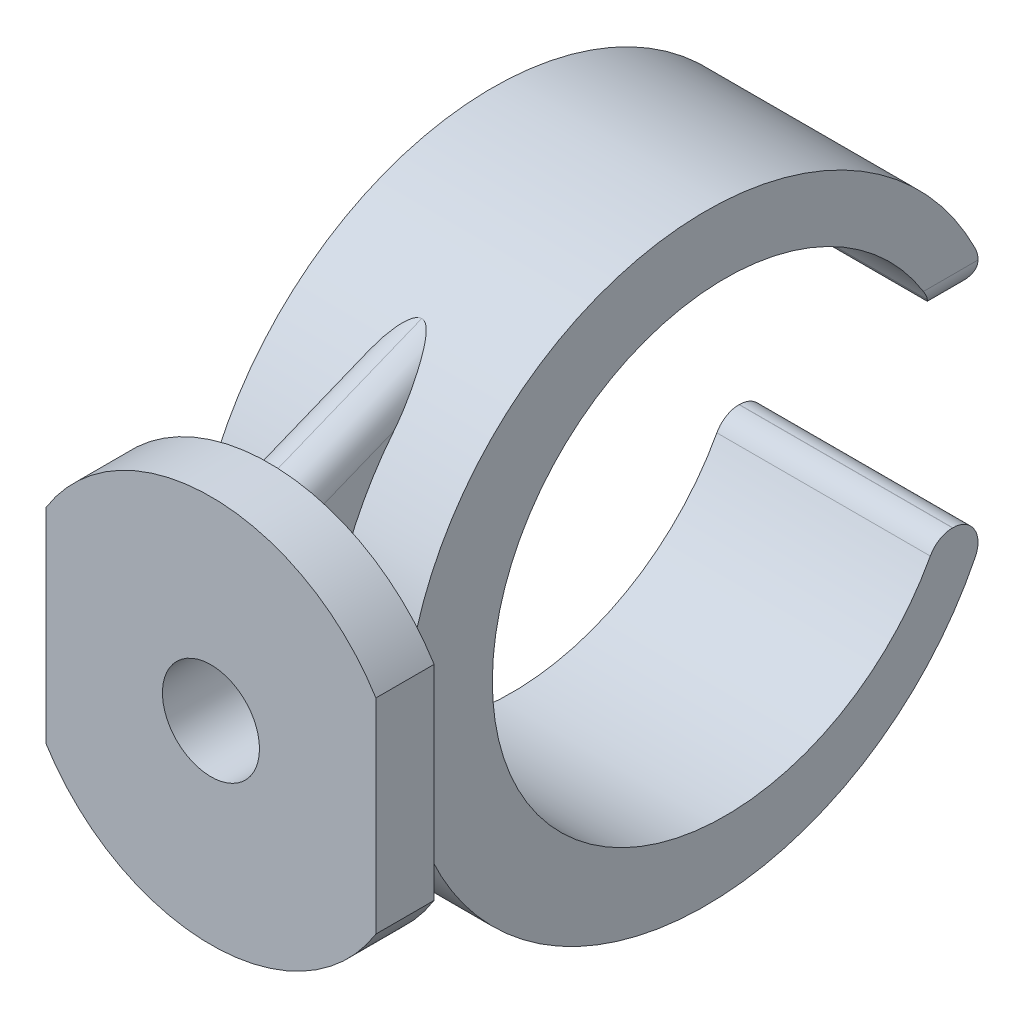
ISO-10303-21;
HEADER;
FILE_DESCRIPTION(('STEP AP214'),'2;1');
FILE_NAME('part.step','',(''),(''),'','','');
FILE_SCHEMA(('AUTOMOTIVE_DESIGN { 1 0 10303 214 1 1 1 1 }'));
ENDSEC;
DATA;
#1=APPLICATION_CONTEXT('core data for automotive mechanical design processes');
#2=APPLICATION_PROTOCOL_DEFINITION('international standard','automotive_design',2000,#1);
#3=PRODUCT_CONTEXT('',#1,'mechanical');
#4=PRODUCT('Part','Part','',(#3));
#5=PRODUCT_RELATED_PRODUCT_CATEGORY('part','',(#4));
#6=PRODUCT_DEFINITION_FORMATION('','',#4);
#7=PRODUCT_DEFINITION_CONTEXT('part definition',#1,'design');
#8=PRODUCT_DEFINITION('design','',#6,#7);
#9=PRODUCT_DEFINITION_SHAPE('','',#8);
#10=(LENGTH_UNIT() NAMED_UNIT(*) SI_UNIT(.MILLI.,.METRE.));
#11=(NAMED_UNIT(*) PLANE_ANGLE_UNIT() SI_UNIT($,.RADIAN.));
#12=(NAMED_UNIT(*) SI_UNIT($,.STERADIAN.) SOLID_ANGLE_UNIT());
#13=UNCERTAINTY_MEASURE_WITH_UNIT(LENGTH_MEASURE(1.E-05),#10,'distance_accuracy_value','');
#14=(GEOMETRIC_REPRESENTATION_CONTEXT(3) GLOBAL_UNCERTAINTY_ASSIGNED_CONTEXT((#13)) GLOBAL_UNIT_ASSIGNED_CONTEXT((#10,
#11,#12)) REPRESENTATION_CONTEXT('',''));
#15=CARTESIAN_POINT('',(0.,0.,0.));
#16=DIRECTION('',(0.,0.,1.));
#17=DIRECTION('',(1.,0.,0.));
#18=AXIS2_PLACEMENT_3D('',#15,#16,#17);
#19=CARTESIAN_POINT('',(0.,0.,0.));
#20=DIRECTION('',(0.,0.,1.));
#21=DIRECTION('',(1.,0.,0.));
#22=AXIS2_PLACEMENT_3D('',#19,#20,#21);
#23=PLANE('',#22);
#24=CARTESIAN_POINT('',(0.,0.,0.));
#25=DIRECTION('',(0.,0.,1.));
#26=DIRECTION('',(1.,0.,0.));
#27=AXIS2_PLACEMENT_3D('',#24,#25,#26);
#28=CIRCLE('',#27,10.);
#29=CARTESIAN_POINT('',(-8.5,-5.26782687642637,0.));
#30=VERTEX_POINT('',#29);
#31=CARTESIAN_POINT('',(8.5,-5.26782687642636,0.));
#32=VERTEX_POINT('',#31);
#33=EDGE_CURVE('E286',#30,#32,#28,.T.);
#34=ORIENTED_EDGE('',*,*,#33,.F.);
#35=DIRECTION('',(0.,1.,0.));
#36=VECTOR('',#35,1.);
#37=CARTESIAN_POINT('',(-8.5,0.,0.));
#38=LINE('',#37,#36);
#39=CARTESIAN_POINT('',(-8.5,5.26782687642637,0.));
#40=VERTEX_POINT('',#39);
#41=EDGE_CURVE('E297',#30,#40,#38,.T.);
#42=ORIENTED_EDGE('',*,*,#41,.T.);
#43=CARTESIAN_POINT('',(8.5,5.26782687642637,0.));
#44=VERTEX_POINT('',#43);
#45=EDGE_CURVE('E292',#44,#40,#28,.T.);
#46=ORIENTED_EDGE('',*,*,#45,.F.);
#47=DIRECTION('',(0.,-1.,0.));
#48=VECTOR('',#47,1.);
#49=CARTESIAN_POINT('',(8.5,0.,0.));
#50=LINE('',#49,#48);
#51=EDGE_CURVE('E290',#44,#32,#50,.T.);
#52=ORIENTED_EDGE('',*,*,#51,.T.);
#53=EDGE_LOOP('',(#34,#42,#46,#52));
#54=FACE_BOUND('',#53,.T.);
#55=CARTESIAN_POINT('',(0.,-7.72559838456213,0.));
#56=DIRECTION('',(0.,0.,1.));
#57=DIRECTION('',(0.,1.,0.));
#58=AXIS2_PLACEMENT_3D('',#55,#56,#57);
#59=ELLIPSE('',#58,1.61779712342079,1.5);
#60=CARTESIAN_POINT('',(-1.5,-7.72559838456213,0.));
#61=VERTEX_POINT('',#60);
#62=CARTESIAN_POINT('',(0.,-9.34339550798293,0.));
#63=VERTEX_POINT('',#62);
#64=EDGE_CURVE('E55',#61,#63,#59,.T.);
#65=ORIENTED_EDGE('',*,*,#64,.T.);
#66=CARTESIAN_POINT('',(0.,-7.72559838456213,0.));
#67=DIRECTION('',(0.,0.,1.));
#68=DIRECTION('',(0.,-1.,0.));
#69=AXIS2_PLACEMENT_3D('',#66,#67,#68);
#70=ELLIPSE('',#69,1.61779712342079,1.5);
#71=CARTESIAN_POINT('',(1.5,-7.72559838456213,0.));
#72=VERTEX_POINT('',#71);
#73=EDGE_CURVE('E11',#63,#72,#70,.T.);
#74=ORIENTED_EDGE('',*,*,#73,.T.);
#75=DIRECTION('',(0.,1.,0.));
#76=VECTOR('',#75,1.);
#77=CARTESIAN_POINT('',(1.5,0.,0.));
#78=LINE('',#77,#76);
#79=CARTESIAN_POINT('',(1.5,-4.76969600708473,0.));
#80=VERTEX_POINT('',#79);
#81=EDGE_CURVE('E225',#72,#80,#78,.T.);
#82=ORIENTED_EDGE('',*,*,#81,.T.);
#83=CARTESIAN_POINT('',(0.,0.,0.));
#84=DIRECTION('',(0.,0.,-1.));
#85=DIRECTION('',(-1.,0.,0.));
#86=AXIS2_PLACEMENT_3D('',#83,#84,#85);
#87=CIRCLE('',#86,5.);
#88=CARTESIAN_POINT('',(1.5,4.76969600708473,0.));
#89=VERTEX_POINT('',#88);
#90=EDGE_CURVE('E224',#89,#80,#87,.T.);
#91=ORIENTED_EDGE('',*,*,#90,.F.);
#92=DIRECTION('',(0.,1.,0.));
#93=VECTOR('',#92,1.);
#94=CARTESIAN_POINT('',(1.5,0.,0.));
#95=LINE('',#94,#93);
#96=CARTESIAN_POINT('',(1.5,7.72559838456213,0.));
#97=VERTEX_POINT('',#96);
#98=EDGE_CURVE('E242',#89,#97,#95,.T.);
#99=ORIENTED_EDGE('',*,*,#98,.T.);
#100=CARTESIAN_POINT('',(0.,7.72559838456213,0.));
#101=DIRECTION('',(0.,0.,1.));
#102=DIRECTION('',(0.,-1.,0.));
#103=AXIS2_PLACEMENT_3D('',#100,#101,#102);
#104=ELLIPSE('',#103,1.61779712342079,1.5);
#105=CARTESIAN_POINT('',(0.,9.34339550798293,0.));
#106=VERTEX_POINT('',#105);
#107=EDGE_CURVE('E662',#97,#106,#104,.T.);
#108=ORIENTED_EDGE('',*,*,#107,.T.);
#109=CARTESIAN_POINT('',(0.,7.72559838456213,0.));
#110=DIRECTION('',(0.,0.,1.));
#111=DIRECTION('',(0.,1.,0.));
#112=AXIS2_PLACEMENT_3D('',#109,#110,#111);
#113=ELLIPSE('',#112,1.61779712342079,1.5);
#114=CARTESIAN_POINT('',(-1.5,7.72559838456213,0.));
#115=VERTEX_POINT('',#114);
#116=EDGE_CURVE('E653',#106,#115,#113,.T.);
#117=ORIENTED_EDGE('',*,*,#116,.T.);
#118=DIRECTION('',(0.,1.,0.));
#119=VECTOR('',#118,1.);
#120=CARTESIAN_POINT('',(-1.5,0.,0.));
#121=LINE('',#120,#119);
#122=CARTESIAN_POINT('',(-1.5,4.76969600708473,0.));
#123=VERTEX_POINT('',#122);
#124=EDGE_CURVE('E248',#123,#115,#121,.T.);
#125=ORIENTED_EDGE('',*,*,#124,.F.);
#126=CARTESIAN_POINT('',(-1.5,-4.76969600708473,0.));
#127=VERTEX_POINT('',#126);
#128=EDGE_CURVE('E269',#127,#123,#87,.T.);
#129=ORIENTED_EDGE('',*,*,#128,.F.);
#130=DIRECTION('',(0.,1.,0.));
#131=VECTOR('',#130,1.);
#132=CARTESIAN_POINT('',(-1.5,0.,0.));
#133=LINE('',#132,#131);
#134=EDGE_CURVE('E238',#61,#127,#133,.T.);
#135=ORIENTED_EDGE('',*,*,#134,.F.);
#136=EDGE_LOOP('',(#65,#74,#82,#91,#99,#108,#117,#125,#129,#135));
#137=FACE_BOUND('',#136,.T.);
#138=ADVANCED_FACE('F33',(#54,#137),#23,.F.);
#139=CARTESIAN_POINT('',(0.,0.,-5.));
#140=DIRECTION('',(0.,0.,1.));
#141=DIRECTION('',(1.,0.,0.));
#142=AXIS2_PLACEMENT_3D('',#139,#140,#141);
#143=CYLINDRICAL_SURFACE('',#142,5.);
#144=DIRECTION('',(0.,0.,1.));
#145=VECTOR('',#144,1.);
#146=CARTESIAN_POINT('',(-1.5,-4.76969600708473,-5.));
#147=LINE('',#146,#145);
#148=CARTESIAN_POINT('',(-1.5,-4.76969600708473,-2.25211879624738));
#149=VERTEX_POINT('',#148);
#150=EDGE_CURVE('E228',#127,#149,#147,.F.);
#151=ORIENTED_EDGE('',*,*,#150,.F.);
#152=ORIENTED_EDGE('',*,*,#128,.T.);
#153=DIRECTION('',(0.,0.,1.));
#154=VECTOR('',#153,1.);
#155=CARTESIAN_POINT('',(-1.5,4.76969600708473,-5.));
#156=LINE('',#155,#154);
#157=CARTESIAN_POINT('',(-1.5,4.76969600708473,-2.25211879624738));
#158=VERTEX_POINT('',#157);
#159=EDGE_CURVE('E245',#158,#123,#156,.T.);
#160=ORIENTED_EDGE('',*,*,#159,.F.);
#161=CARTESIAN_POINT('',(5.,0.,-1.5));
#162=CARTESIAN_POINT('',(4.99999961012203,0.273308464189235,-1.50000041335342));
#163=CARTESIAN_POINT('',(4.97751733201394,0.546623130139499,-1.50729628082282));
#164=CARTESIAN_POINT('',(4.88843669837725,1.08523197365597,-1.53568433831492));
#165=CARTESIAN_POINT('',(4.82183095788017,1.35052480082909,-1.55677883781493));
#166=CARTESIAN_POINT('',(4.64700297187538,1.86524635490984,-1.610465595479));
#167=CARTESIAN_POINT('',(4.53884761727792,2.11469983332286,-1.64303936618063));
#168=CARTESIAN_POINT('',(4.28428361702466,2.5919290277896,-1.71633980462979));
#169=CARTESIAN_POINT('',(4.13786819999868,2.81970089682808,-1.75706791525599));
#170=CARTESIAN_POINT('',(3.80590860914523,3.25454580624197,-1.84386020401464));
#171=CARTESIAN_POINT('',(3.61933890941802,3.46081152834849,-1.89004622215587));
#172=CARTESIAN_POINT('',(3.21454875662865,3.83973498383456,-1.98186023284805));
#173=CARTESIAN_POINT('',(2.99632192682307,4.01238592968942,-2.02748811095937));
#174=CARTESIAN_POINT('',(2.52729051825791,4.32366580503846,-2.11434276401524));
#175=CARTESIAN_POINT('',(2.27577337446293,4.46126675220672,-2.15542005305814));
#176=CARTESIAN_POINT('',(1.75162862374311,4.69187659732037,-2.22668051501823));
#177=CARTESIAN_POINT('',(1.47900701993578,4.78489812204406,-2.25686677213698));
#178=CARTESIAN_POINT('',(0.92953663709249,4.9207189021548,-2.30164888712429));
#179=CARTESIAN_POINT('',(0.653098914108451,4.96502310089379,-2.31671059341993));
#180=CARTESIAN_POINT('',(0.0963350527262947,5.00685479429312,-2.33091895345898));
#181=CARTESIAN_POINT('',(-0.183989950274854,5.00439567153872,-2.33007016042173));
#182=CARTESIAN_POINT('',(-0.727940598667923,4.95394348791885,-2.31296322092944));
#183=CARTESIAN_POINT('',(-0.99177004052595,4.90788741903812,-2.29736061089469));
#184=CARTESIAN_POINT('',(-1.5077360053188,4.77469847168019,-2.25357267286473));
#185=CARTESIAN_POINT('',(-1.75987120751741,4.68756096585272,-2.22538592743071));
#186=CARTESIAN_POINT('',(-2.24980370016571,4.47336280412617,-2.15912021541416));
#187=CARTESIAN_POINT('',(-2.48732179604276,4.34571036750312,-2.1208961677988));
#188=CARTESIAN_POINT('',(-2.9381905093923,4.05451678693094,-2.03892649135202));
#189=CARTESIAN_POINT('',(-3.15153448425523,3.89096581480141,-1.99517935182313));
#190=CARTESIAN_POINT('',(-3.5589184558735,3.52320909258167,-1.90448702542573));
#191=CARTESIAN_POINT('',(-3.75151272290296,3.31741156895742,-1.8574898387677));
#192=CARTESIAN_POINT('',(-4.09981957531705,2.87585745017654,-1.76746417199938));
#193=CARTESIAN_POINT('',(-4.25552905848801,2.64009833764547,-1.72443602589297));
#194=CARTESIAN_POINT('',(-4.52671279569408,2.14239406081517,-1.6466924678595));
#195=CARTESIAN_POINT('',(-4.64182200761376,1.88023727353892,-1.61205331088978));
#196=CARTESIAN_POINT('',(-4.825868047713,1.33890004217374,-1.5555423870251));
#197=CARTESIAN_POINT('',(-4.89481985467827,1.05972515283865,-1.53366647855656));
#198=CARTESIAN_POINT('',(-4.98208421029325,0.504532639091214,-1.50582269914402));
#199=CARTESIAN_POINT('',(-5.00235217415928,0.228852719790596,-1.4992409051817));
#200=CARTESIAN_POINT('',(-4.99721390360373,-0.322009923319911,-1.5008990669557));
#201=CARTESIAN_POINT('',(-4.97181483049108,-0.597192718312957,-1.50913669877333));
#202=CARTESIAN_POINT('',(-4.87762293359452,-1.13157213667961,-1.53910373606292));
#203=CARTESIAN_POINT('',(-4.81001111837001,-1.39099953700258,-1.5604657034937));
#204=CARTESIAN_POINT('',(-4.63477094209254,-1.89474114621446,-1.61415663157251));
#205=CARTESIAN_POINT('',(-4.52713755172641,-2.13905345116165,-1.64648697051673));
#206=CARTESIAN_POINT('',(-4.27187257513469,-2.61252171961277,-1.71982941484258));
#207=CARTESIAN_POINT('',(-4.12329666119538,-2.84113683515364,-1.76104073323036));
#208=CARTESIAN_POINT('',(-3.79148565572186,-3.27083673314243,-1.84745092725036));
#209=CARTESIAN_POINT('',(-3.60824058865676,-3.47191356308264,-1.89265094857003));
#210=CARTESIAN_POINT('',(-3.20309376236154,-3.84968836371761,-1.9843642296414));
#211=CARTESIAN_POINT('',(-2.97988257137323,-4.02499150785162,-2.03085193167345));
#212=CARTESIAN_POINT('',(-2.50620513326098,-4.33580042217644,-2.11789753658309));
#213=CARTESIAN_POINT('',(-2.25573903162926,-4.47130640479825,-2.15845547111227));
#214=CARTESIAN_POINT('',(-1.73490209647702,-4.69792389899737,-2.22862141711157));
#215=CARTESIAN_POINT('',(-1.46459529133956,-4.78917156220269,-2.25826294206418));
#216=CARTESIAN_POINT('',(-0.911288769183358,-4.92448763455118,-2.3029051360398));
#217=CARTESIAN_POINT('',(-0.628294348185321,-4.96857554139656,-2.31791185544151));
#218=CARTESIAN_POINT('',(-0.0723052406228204,-5.00686161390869,-2.33092705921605));
#219=CARTESIAN_POINT('',(0.200514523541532,-5.0033605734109,-2.32971949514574));
#220=CARTESIAN_POINT('',(0.741468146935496,-4.95217400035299,-2.312362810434));
#221=CARTESIAN_POINT('',(1.00960225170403,-4.90449079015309,-2.2962144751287));
#222=CARTESIAN_POINT('',(1.52916190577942,-4.76787683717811,-2.2513610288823));
#223=CARTESIAN_POINT('',(1.78079124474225,-4.67964567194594,-2.22286933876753));
#224=CARTESIAN_POINT('',(2.26587255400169,-4.46499823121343,-2.15660588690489));
#225=CARTESIAN_POINT('',(2.4993206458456,-4.33857383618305,-2.11883215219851));
#226=CARTESIAN_POINT('',(2.95185745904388,-4.04502779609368,-2.0363147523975));
#227=CARTESIAN_POINT('',(3.16995474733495,-3.87644081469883,-1.99134763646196));
#228=CARTESIAN_POINT('',(3.57550775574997,-3.50588508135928,-1.90049293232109));
#229=CARTESIAN_POINT('',(3.76295503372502,-3.30390716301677,-1.85460509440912));
#230=CARTESIAN_POINT('',(4.10859192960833,-2.86365656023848,-1.76511818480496));
#231=CARTESIAN_POINT('',(4.26550190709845,-2.62434750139,-1.72165881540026));
#232=CARTESIAN_POINT('',(4.53667459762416,-2.12135464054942,-1.64374780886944));
#233=CARTESIAN_POINT('',(4.6509513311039,-1.85767888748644,-1.60929321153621));
#234=CARTESIAN_POINT('',(4.82696562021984,-1.33127750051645,-1.55516109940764));
#235=CARTESIAN_POINT('',(4.89165688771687,-1.06962325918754,-1.53466277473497));
#236=CARTESIAN_POINT('',(4.97816922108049,-0.538646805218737,-1.50708360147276));
#237=CARTESIAN_POINT('',(5.00000038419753,-0.269326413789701,-1.49999959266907));
#238=CARTESIAN_POINT('',(5.,0.,-1.5));
#239=B_SPLINE_CURVE_WITH_KNOTS('',3,(#161,#162,#163,#164,#165,#166,#167,#168,#169,#170,#171,
#172,#173,#174,#175,#176,#177,#178,#179,#180,#181,#182,#183,#184,#185,#186,#187,#188,#189,#190,
#191,#192,#193,#194,#195,#196,#197,#198,#199,#200,#201,#202,#203,#204,#205,#206,#207,#208,#209,
#210,#211,#212,#213,#214,#215,#216,#217,#218,#219,#220,#221,#222,#223,#224,#225,#226,#227,#228,
#229,#230,#231,#232,#233,#234,#235,#236,#237,#238),.UNSPECIFIED.,.T.,.F.,(4,2,2,2,2,2,2,2,2,2,2,
2,2,2,2,2,2,2,2,2,2,2,2,2,2,2,2,2,2,2,2,2,2,2,2,2,2,2,4),(0.,0.818934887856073,1.63800687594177,
2.45576572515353,3.27366940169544,4.11566491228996,4.95783026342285,5.82241350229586,
6.68675170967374,7.52356606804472,8.36014095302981,9.16120972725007,9.96236875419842,
10.7758146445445,11.5894835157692,12.4427707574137,13.2961297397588,14.1569767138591,
15.0175441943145,15.8429218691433,16.6681701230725,17.4713051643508,18.2745411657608,
19.0981285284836,19.921953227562,20.7807016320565,21.6394454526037,22.4955304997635,
23.3512614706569,24.1657736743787,24.9802430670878,25.7811593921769,26.5822461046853,
27.4164224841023,28.2508282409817,29.1149487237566,29.9787847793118,30.7859781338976,
31.5929813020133),.UNSPECIFIED.);
#240=EDGE_CURVE('E218',#158,#149,#239,.T.);
#241=ORIENTED_EDGE('',*,*,#240,.T.);
#242=EDGE_LOOP('',(#151,#152,#160,#241));
#243=FACE_BOUND('',#242,.T.);
#244=ADVANCED_FACE('F312',(#243),#143,.T.);
#245=CARTESIAN_POINT('',(-5.5,0.,-17.));
#246=DIRECTION('',(1.,0.,0.));
#247=DIRECTION('',(0.,0.,-1.));
#248=AXIS2_PLACEMENT_3D('',#245,#246,#247);
#249=CYLINDRICAL_SURFACE('',#248,15.5);
#250=CARTESIAN_POINT('',(5.5,0.,-17.));
#251=DIRECTION('',(1.,0.,0.));
#252=DIRECTION('',(0.,0.,-1.));
#253=AXIS2_PLACEMENT_3D('',#250,#251,#252);
#254=CIRCLE('',#253,15.5);
#255=CARTESIAN_POINT('',(5.5,6.87676056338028,-30.8910101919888));
#256=VERTEX_POINT('',#255);
#257=CARTESIAN_POINT('',(5.5,-6.87676056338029,-30.8910101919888));
#258=VERTEX_POINT('',#257);
#259=EDGE_CURVE('E259',#256,#258,#254,.T.);
#260=ORIENTED_EDGE('',*,*,#259,.F.);
#261=DIRECTION('',(1.,0.,0.));
#262=VECTOR('',#261,1.);
#263=CARTESIAN_POINT('',(-5.5,6.87676056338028,-30.8910101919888));
#264=LINE('',#263,#262);
#265=CARTESIAN_POINT('',(-5.5,6.87676056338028,-30.8910101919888));
#266=VERTEX_POINT('',#265);
#267=EDGE_CURVE('E684',#256,#266,#264,.F.);
#268=ORIENTED_EDGE('',*,*,#267,.T.);
#269=CARTESIAN_POINT('',(-5.5,0.,-17.));
#270=DIRECTION('',(1.,0.,0.));
#271=DIRECTION('',(0.,0.,-1.));
#272=AXIS2_PLACEMENT_3D('',#269,#270,#271);
#273=CIRCLE('',#272,15.5);
#274=CARTESIAN_POINT('',(-5.5,-6.87676056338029,-30.8910101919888));
#275=VERTEX_POINT('',#274);
#276=EDGE_CURVE('E219',#266,#275,#273,.T.);
#277=ORIENTED_EDGE('',*,*,#276,.T.);
#278=DIRECTION('',(1.,0.,0.));
#279=VECTOR('',#278,1.);
#280=CARTESIAN_POINT('',(-5.5,-6.87676056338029,-30.8910101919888));
#281=LINE('',#280,#279);
#282=EDGE_CURVE('E686',#275,#258,#281,.T.);
#283=ORIENTED_EDGE('',*,*,#282,.T.);
#284=EDGE_LOOP('',(#260,#268,#277,#283));
#285=FACE_BOUND('',#284,.T.);
#286=CARTESIAN_POINT('',(1.5,0.,-17.));
#287=DIRECTION('',(1.,0.,0.));
#288=DIRECTION('',(0.,0.,-1.));
#289=AXIS2_PLACEMENT_3D('',#286,#287,#288);
#290=CIRCLE('',#289,15.5);
#291=CARTESIAN_POINT('',(1.5,-9.71400369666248,-4.92158403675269));
#292=VERTEX_POINT('',#291);
#293=CARTESIAN_POINT('',(1.5,-4.76969600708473,-2.25211879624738));
#294=VERTEX_POINT('',#293);
#295=EDGE_CURVE('E200',#292,#294,#290,.F.);
#296=ORIENTED_EDGE('',*,*,#295,.F.);
#297=CARTESIAN_POINT('',(1.5,-9.71400369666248,-4.92158403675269));
#298=CARTESIAN_POINT('',(1.49998611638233,-9.78953749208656,-4.98232910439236));
#299=CARTESIAN_POINT('',(1.49776518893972,-9.86448561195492,-5.04377503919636));
#300=CARTESIAN_POINT('',(1.48925597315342,-10.0130627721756,-5.16792804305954));
#301=CARTESIAN_POINT('',(1.48296882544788,-10.0866921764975,-5.23063475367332));
#302=CARTESIAN_POINT('',(1.46667427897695,-10.2325197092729,-5.35719686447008));
#303=CARTESIAN_POINT('',(1.45666723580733,-10.3047179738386,-5.42105215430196));
#304=CARTESIAN_POINT('',(1.43318522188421,-10.447602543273,-5.54980992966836));
#305=CARTESIAN_POINT('',(1.41970998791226,-10.5182887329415,-5.61471249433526));
#306=CARTESIAN_POINT('',(1.37436874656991,-10.7280757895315,-5.81094009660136));
#307=CARTESIAN_POINT('',(1.33759903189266,-10.8648043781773,-5.94369749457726));
#308=CARTESIAN_POINT('',(1.2518529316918,-11.1313453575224,-6.2120951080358));
#309=CARTESIAN_POINT('',(1.20288064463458,-11.2611600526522,-6.34773434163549));
#310=CARTESIAN_POINT('',(1.13080577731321,-11.4252985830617,-6.52547312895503));
#311=CARTESIAN_POINT('',(1.11349371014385,-11.463052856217,-6.56680628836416));
#312=CARTESIAN_POINT('',(1.07763898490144,-11.5378437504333,-6.64957623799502));
#313=CARTESIAN_POINT('',(1.05909650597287,-11.5748804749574,-6.69101301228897));
#314=CARTESIAN_POINT('',(1.00156845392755,-11.6847946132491,-6.81531599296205));
#315=CARTESIAN_POINT('',(0.960640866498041,-11.7565711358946,-6.89827798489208));
#316=CARTESIAN_POINT('',(0.885619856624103,-11.8759728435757,-7.03922228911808));
#317=CARTESIAN_POINT('',(0.85309742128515,-11.9244496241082,-7.09731870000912));
#318=CARTESIAN_POINT('',(0.784236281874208,-12.0195530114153,-7.21296982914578));
#319=CARTESIAN_POINT('',(0.747891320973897,-12.0661764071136,-7.27052348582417));
#320=CARTESIAN_POINT('',(0.66953442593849,-12.157962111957,-7.38545640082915));
#321=CARTESIAN_POINT('',(0.627422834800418,-12.203075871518,-7.44280864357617));
#322=CARTESIAN_POINT('',(0.558869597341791,-12.2679586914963,-7.5264346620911));
#323=CARTESIAN_POINT('',(0.535155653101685,-12.2890956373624,-7.55387502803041));
#324=CARTESIAN_POINT('',(0.485468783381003,-12.3301762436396,-7.60756207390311));
#325=CARTESIAN_POINT('',(0.459497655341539,-12.3501208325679,-7.63380967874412));
#326=CARTESIAN_POINT('',(0.409428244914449,-12.3850532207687,-7.68006727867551));
#327=CARTESIAN_POINT('',(0.385786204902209,-12.4003008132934,-7.70036963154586));
#328=CARTESIAN_POINT('',(0.33598833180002,-12.4292751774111,-7.73913047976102));
#329=CARTESIAN_POINT('',(0.309825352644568,-12.4429973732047,-7.75758341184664));
#330=CARTESIAN_POINT('',(0.25402748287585,-12.4683635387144,-7.79183129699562));
#331=CARTESIAN_POINT('',(0.224337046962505,-12.479964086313,-7.80757040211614));
#332=CARTESIAN_POINT('',(0.161763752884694,-12.4993784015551,-7.83398606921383));
#333=CARTESIAN_POINT('',(0.128911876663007,-12.5072251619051,-7.84470672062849));
#334=CARTESIAN_POINT('',(0.0794956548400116,-12.5147815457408,-7.85504185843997));
#335=CARTESIAN_POINT('',(0.0638377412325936,-12.5165946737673,-7.85752413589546));
#336=CARTESIAN_POINT('',(0.0321295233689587,-12.5190524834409,-7.86089028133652));
#337=CARTESIAN_POINT('',(0.0160770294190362,-12.5196872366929,-7.86176056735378));
#338=CARTESIAN_POINT('',(0.,-12.519677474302,-7.86174655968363));
#339=B_SPLINE_CURVE_WITH_KNOTS('',3,(#297,#298,#299,#300,#301,#302,#303,#304,#305,#306,#307,
#308,#309,#310,#311,#312,#313,#314,#315,#316,#317,#318,#319,#320,#321,#322,#323,#324,#325,#326,
#327,#328,#329,#330,#331,#332,#333,#334,#335,#336,#337,#338),.UNSPECIFIED.,.F.,.F.,(4,2,2,2,2,2,
2,2,2,2,2,2,2,2,2,2,2,2,2,2,4),(0.,0.29073407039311,0.581386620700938,0.872011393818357,
1.16265823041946,1.7443527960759,2.32585225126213,2.50162832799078,2.67737886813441,
3.02844152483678,3.27542858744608,3.52282641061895,3.77522251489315,3.90108930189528,
4.02685676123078,4.13081428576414,4.23507568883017,4.34127715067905,4.44652721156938,
4.49427983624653,4.54243300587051),.UNSPECIFIED.);
#340=CARTESIAN_POINT('',(0.,-12.519677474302,-7.86174655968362));
#341=VERTEX_POINT('',#340);
#342=EDGE_CURVE('E48',#292,#341,#339,.T.);
#343=ORIENTED_EDGE('',*,*,#342,.T.);
#344=CARTESIAN_POINT('',(0.,-12.519677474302,-7.86174655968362));
#345=CARTESIAN_POINT('',(-0.0265936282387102,-12.5197415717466,-7.86183796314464));
#346=CARTESIAN_POINT('',(-0.0529965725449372,-12.5179719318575,-7.85940951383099));
#347=CARTESIAN_POINT('',(-0.104210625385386,-12.5114337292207,-7.85046058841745));
#348=CARTESIAN_POINT('',(-0.129042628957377,-12.5067237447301,-7.84402004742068));
#349=CARTESIAN_POINT('',(-0.183423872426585,-12.4933446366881,-7.82577036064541));
#350=CARTESIAN_POINT('',(-0.212448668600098,-12.4839519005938,-7.81298387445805));
#351=CARTESIAN_POINT('',(-0.267863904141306,-12.4625299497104,-7.78394455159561));
#352=CARTESIAN_POINT('',(-0.294230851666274,-12.450479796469,-7.76766421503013));
#353=CARTESIAN_POINT('',(-0.34933454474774,-12.4221291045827,-7.729542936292));
#354=CARTESIAN_POINT('',(-0.377547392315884,-12.4054570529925,-7.7072351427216));
#355=CARTESIAN_POINT('',(-0.431218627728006,-12.3704367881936,-7.66066662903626));
#356=CARTESIAN_POINT('',(-0.456671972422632,-12.3520856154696,-7.63640247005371));
#357=CARTESIAN_POINT('',(-0.505459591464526,-12.3141217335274,-7.58653133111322));
#358=CARTESIAN_POINT('',(-0.528784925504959,-12.2945042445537,-7.56091934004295));
#359=CARTESIAN_POINT('',(-0.573612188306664,-12.2543752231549,-7.50887947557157));
#360=CARTESIAN_POINT('',(-0.595115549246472,-12.2338644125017,-7.48245226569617));
#361=CARTESIAN_POINT('',(-0.649615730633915,-12.1790728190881,-7.41234061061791));
#362=CARTESIAN_POINT('',(-0.681403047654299,-12.1441925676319,-7.36818651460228));
#363=CARTESIAN_POINT('',(-0.741992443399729,-12.0729427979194,-7.27902674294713));
#364=CARTESIAN_POINT('',(-0.770792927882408,-12.0365724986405,-7.23402062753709));
#365=CARTESIAN_POINT('',(-0.853685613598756,-11.9254918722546,-7.09816620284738));
#366=CARTESIAN_POINT('',(-0.904162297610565,-11.8489255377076,-7.00662781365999));
#367=CARTESIAN_POINT('',(-0.998095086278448,-11.6916901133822,-6.82311152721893));
#368=CARTESIAN_POINT('',(-1.04153342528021,-11.6110112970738,-6.73113310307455));
#369=CARTESIAN_POINT('',(-1.12229809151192,-11.4462083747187,-6.54775155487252));
#370=CARTESIAN_POINT('',(-1.159629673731,-11.3620873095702,-6.45634800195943));
#371=CARTESIAN_POINT('',(-1.24245014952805,-11.1565126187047,-6.23836815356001));
#372=CARTESIAN_POINT('',(-1.28528760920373,-11.0335045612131,-6.11224491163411));
#373=CARTESIAN_POINT('',(-1.36021910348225,-10.7815361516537,-5.8626785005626));
#374=CARTESIAN_POINT('',(-1.39230998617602,-10.652574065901,-5.7392361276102));
#375=CARTESIAN_POINT('',(-1.43152016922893,-10.4561184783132,-5.55764992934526));
#376=CARTESIAN_POINT('',(-1.4430426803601,-10.3906871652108,-5.49819717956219));
#377=CARTESIAN_POINT('',(-1.46310360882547,-10.2585615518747,-5.38019977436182));
#378=CARTESIAN_POINT('',(-1.47164223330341,-10.1918673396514,-5.32165505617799));
#379=CARTESIAN_POINT('',(-1.48552942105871,-10.0572802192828,-5.2055516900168));
#380=CARTESIAN_POINT('',(-1.49087759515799,-9.98938716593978,-5.14799316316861));
#381=CARTESIAN_POINT('',(-1.4981082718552,-9.85249549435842,-5.03395291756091));
#382=CARTESIAN_POINT('',(-1.49998994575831,-9.78349661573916,-4.97747145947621));
#383=CARTESIAN_POINT('',(-1.50000000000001,-9.71400369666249,-4.92158403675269));
#384=B_SPLINE_CURVE_WITH_KNOTS('',3,(#344,#345,#346,#347,#348,#349,#350,#351,#352,#353,#354,
#355,#356,#357,#358,#359,#360,#361,#362,#363,#364,#365,#366,#367,#368,#369,#370,#371,#372,#373,
#374,#375,#376,#377,#378,#379,#380,#381,#382,#383),.UNSPECIFIED.,.F.,.F.,(4,2,2,2,2,2,2,2,2,2,2,
2,2,2,2,2,2,2,2,4),(0.,0.0793088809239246,0.157086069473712,0.255753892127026,0.355228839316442,
0.473891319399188,0.592767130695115,0.712121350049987,0.831380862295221,1.02512455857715,
1.21897114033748,1.60730289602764,1.99660007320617,2.38556046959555,2.92904840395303,
3.47269560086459,3.74010940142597,4.00750463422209,4.27493247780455,4.54242424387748),.UNSPECIFIED.);
#385=CARTESIAN_POINT('',(-1.5,-9.71400369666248,-4.92158403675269));
#386=VERTEX_POINT('',#385);
#387=EDGE_CURVE('E337',#341,#386,#384,.T.);
#388=ORIENTED_EDGE('',*,*,#387,.T.);
#389=CARTESIAN_POINT('',(-1.5,0.,-17.));
#390=DIRECTION('',(1.,0.,0.));
#391=DIRECTION('',(0.,0.,-1.));
#392=AXIS2_PLACEMENT_3D('',#389,#390,#391);
#393=CIRCLE('',#392,15.5);
#394=EDGE_CURVE('E208',#386,#149,#393,.F.);
#395=ORIENTED_EDGE('',*,*,#394,.T.);
#396=ORIENTED_EDGE('',*,*,#240,.F.);
#397=CARTESIAN_POINT('',(-1.5,0.,-17.));
#398=DIRECTION('',(1.,0.,0.));
#399=DIRECTION('',(0.,0.,-1.));
#400=AXIS2_PLACEMENT_3D('',#397,#398,#399);
#401=CIRCLE('',#400,15.5);
#402=CARTESIAN_POINT('',(-1.5,9.71400369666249,-4.92158403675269));
#403=VERTEX_POINT('',#402);
#404=EDGE_CURVE('E209',#158,#403,#401,.F.);
#405=ORIENTED_EDGE('',*,*,#404,.T.);
#406=CARTESIAN_POINT('',(-1.5,9.71400369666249,-4.92158403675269));
#407=CARTESIAN_POINT('',(-1.49998611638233,9.78953749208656,-4.98232910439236));
#408=CARTESIAN_POINT('',(-1.49776518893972,9.86448561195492,-5.04377503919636));
#409=CARTESIAN_POINT('',(-1.48925597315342,10.0130627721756,-5.16792804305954));
#410=CARTESIAN_POINT('',(-1.48296882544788,10.0866921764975,-5.23063475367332));
#411=CARTESIAN_POINT('',(-1.46667427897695,10.2325197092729,-5.35719686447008));
#412=CARTESIAN_POINT('',(-1.45666723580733,10.3047179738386,-5.42105215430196));
#413=CARTESIAN_POINT('',(-1.4331852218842,10.447602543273,-5.54980992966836));
#414=CARTESIAN_POINT('',(-1.41970998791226,10.5182887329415,-5.61471249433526));
#415=CARTESIAN_POINT('',(-1.37436874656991,10.7280757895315,-5.81094009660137));
#416=CARTESIAN_POINT('',(-1.33759903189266,10.8648043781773,-5.94369749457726));
#417=CARTESIAN_POINT('',(-1.2518529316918,11.1313453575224,-6.2120951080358));
#418=CARTESIAN_POINT('',(-1.20288064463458,11.2611600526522,-6.3477343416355));
#419=CARTESIAN_POINT('',(-1.13080577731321,11.4252985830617,-6.52547312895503));
#420=CARTESIAN_POINT('',(-1.11349371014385,11.463052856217,-6.56680628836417));
#421=CARTESIAN_POINT('',(-1.07763898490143,11.5378437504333,-6.64957623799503));
#422=CARTESIAN_POINT('',(-1.05909650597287,11.5748804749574,-6.69101301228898));
#423=CARTESIAN_POINT('',(-1.00156845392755,11.6847946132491,-6.81531599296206));
#424=CARTESIAN_POINT('',(-0.960640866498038,11.7565711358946,-6.89827798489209));
#425=CARTESIAN_POINT('',(-0.885619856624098,11.8759728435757,-7.03922228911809));
#426=CARTESIAN_POINT('',(-0.853097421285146,11.9244496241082,-7.09731870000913));
#427=CARTESIAN_POINT('',(-0.784236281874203,12.0195530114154,-7.21296982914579));
#428=CARTESIAN_POINT('',(-0.747891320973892,12.0661764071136,-7.27052348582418));
#429=CARTESIAN_POINT('',(-0.669534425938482,12.1579621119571,-7.38545640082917));
#430=CARTESIAN_POINT('',(-0.627422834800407,12.203075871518,-7.44280864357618));
#431=CARTESIAN_POINT('',(-0.558869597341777,12.2679586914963,-7.52643466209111));
#432=CARTESIAN_POINT('',(-0.53515565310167,12.2890956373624,-7.55387502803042));
#433=CARTESIAN_POINT('',(-0.485468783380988,12.3301762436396,-7.60756207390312));
#434=CARTESIAN_POINT('',(-0.459497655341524,12.3501208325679,-7.63380967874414));
#435=CARTESIAN_POINT('',(-0.409428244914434,12.3850532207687,-7.68006727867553));
#436=CARTESIAN_POINT('',(-0.385786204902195,12.4003008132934,-7.70036963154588));
#437=CARTESIAN_POINT('',(-0.335988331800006,12.4292751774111,-7.73913047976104));
#438=CARTESIAN_POINT('',(-0.309825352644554,12.4429973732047,-7.75758341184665));
#439=CARTESIAN_POINT('',(-0.254027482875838,12.4683635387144,-7.79183129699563));
#440=CARTESIAN_POINT('',(-0.224337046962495,12.479964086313,-7.80757040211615));
#441=CARTESIAN_POINT('',(-0.161763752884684,12.4993784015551,-7.83398606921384));
#442=CARTESIAN_POINT('',(-0.128911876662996,12.5072251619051,-7.84470672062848));
#443=CARTESIAN_POINT('',(-0.079495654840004,12.5147815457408,-7.85504185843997));
#444=CARTESIAN_POINT('',(-0.0638377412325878,12.5165946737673,-7.85752413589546));
#445=CARTESIAN_POINT('',(-0.0321295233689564,12.5190524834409,-7.86089028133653));
#446=CARTESIAN_POINT('',(-0.0160770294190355,12.5196872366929,-7.86176056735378));
#447=CARTESIAN_POINT('',(0.,12.519677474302,-7.86174655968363));
#448=B_SPLINE_CURVE_WITH_KNOTS('',3,(#406,#407,#408,#409,#410,#411,#412,#413,#414,#415,#416,
#417,#418,#419,#420,#421,#422,#423,#424,#425,#426,#427,#428,#429,#430,#431,#432,#433,#434,#435,
#436,#437,#438,#439,#440,#441,#442,#443,#444,#445,#446,#447),.UNSPECIFIED.,.F.,.F.,(4,2,2,2,2,2,
2,2,2,2,2,2,2,2,2,2,2,2,2,2,4),(0.,0.290734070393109,0.581386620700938,0.872011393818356,
1.16265823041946,1.7443527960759,2.32585225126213,2.50162832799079,2.67737886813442,
3.02844152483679,3.27542858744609,3.52282641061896,3.77522251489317,3.9010893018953,
4.02685676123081,4.13081428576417,4.23507568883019,4.34127715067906,4.44652721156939,
4.49427983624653,4.54243300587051),.UNSPECIFIED.);
#449=CARTESIAN_POINT('',(0.,12.519677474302,-7.86174655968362));
#450=VERTEX_POINT('',#449);
#451=EDGE_CURVE('E321',#403,#450,#448,.T.);
#452=ORIENTED_EDGE('',*,*,#451,.T.);
#453=CARTESIAN_POINT('',(0.,12.519677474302,-7.86174655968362));
#454=CARTESIAN_POINT('',(0.0265936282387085,12.5197415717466,-7.86183796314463));
#455=CARTESIAN_POINT('',(0.0529965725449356,12.5179719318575,-7.85940951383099));
#456=CARTESIAN_POINT('',(0.104210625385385,12.5114337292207,-7.85046058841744));
#457=CARTESIAN_POINT('',(0.129042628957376,12.5067237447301,-7.84402004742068));
#458=CARTESIAN_POINT('',(0.183423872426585,12.4933446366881,-7.82577036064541));
#459=CARTESIAN_POINT('',(0.212448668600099,12.4839519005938,-7.81298387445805));
#460=CARTESIAN_POINT('',(0.267863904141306,12.4625299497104,-7.78394455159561));
#461=CARTESIAN_POINT('',(0.294230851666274,12.450479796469,-7.76766421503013));
#462=CARTESIAN_POINT('',(0.34933454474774,12.4221291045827,-7.729542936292));
#463=CARTESIAN_POINT('',(0.377547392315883,12.4054570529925,-7.7072351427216));
#464=CARTESIAN_POINT('',(0.431218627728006,12.3704367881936,-7.66066662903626));
#465=CARTESIAN_POINT('',(0.456671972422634,12.3520856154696,-7.63640247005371));
#466=CARTESIAN_POINT('',(0.505459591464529,12.3141217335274,-7.58653133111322));
#467=CARTESIAN_POINT('',(0.528784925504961,12.2945042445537,-7.56091934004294));
#468=CARTESIAN_POINT('',(0.573612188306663,12.2543752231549,-7.50887947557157));
#469=CARTESIAN_POINT('',(0.595115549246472,12.2338644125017,-7.48245226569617));
#470=CARTESIAN_POINT('',(0.649615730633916,12.1790728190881,-7.41234061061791));
#471=CARTESIAN_POINT('',(0.681403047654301,12.1441925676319,-7.36818651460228));
#472=CARTESIAN_POINT('',(0.74199244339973,12.0729427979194,-7.27902674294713));
#473=CARTESIAN_POINT('',(0.770792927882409,12.0365724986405,-7.2340206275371));
#474=CARTESIAN_POINT('',(0.853685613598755,11.9254918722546,-7.09816620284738));
#475=CARTESIAN_POINT('',(0.904162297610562,11.8489255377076,-7.00662781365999));
#476=CARTESIAN_POINT('',(0.998095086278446,11.6916901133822,-6.82311152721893));
#477=CARTESIAN_POINT('',(1.04153342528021,11.6110112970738,-6.73113310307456));
#478=CARTESIAN_POINT('',(1.12229809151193,11.4462083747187,-6.54775155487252));
#479=CARTESIAN_POINT('',(1.159629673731,11.3620873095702,-6.45634800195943));
#480=CARTESIAN_POINT('',(1.24245014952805,11.1565126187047,-6.23836815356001));
#481=CARTESIAN_POINT('',(1.28528760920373,11.0335045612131,-6.11224491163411));
#482=CARTESIAN_POINT('',(1.36021910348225,10.7815361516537,-5.8626785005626));
#483=CARTESIAN_POINT('',(1.39230998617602,10.6525740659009,-5.7392361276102));
#484=CARTESIAN_POINT('',(1.43152016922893,10.4561184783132,-5.55764992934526));
#485=CARTESIAN_POINT('',(1.4430426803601,10.3906871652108,-5.49819717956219));
#486=CARTESIAN_POINT('',(1.46310360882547,10.2585615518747,-5.38019977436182));
#487=CARTESIAN_POINT('',(1.47164223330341,10.1918673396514,-5.32165505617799));
#488=CARTESIAN_POINT('',(1.48552942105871,10.0572802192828,-5.2055516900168));
#489=CARTESIAN_POINT('',(1.49087759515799,9.98938716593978,-5.14799316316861));
#490=CARTESIAN_POINT('',(1.4981082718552,9.85249549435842,-5.03395291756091));
#491=CARTESIAN_POINT('',(1.49998994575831,9.78349661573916,-4.97747145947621));
#492=CARTESIAN_POINT('',(1.50000000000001,9.71400369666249,-4.92158403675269));
#493=B_SPLINE_CURVE_WITH_KNOTS('',3,(#453,#454,#455,#456,#457,#458,#459,#460,#461,#462,#463,
#464,#465,#466,#467,#468,#469,#470,#471,#472,#473,#474,#475,#476,#477,#478,#479,#480,#481,#482,
#483,#484,#485,#486,#487,#488,#489,#490,#491,#492),.UNSPECIFIED.,.F.,.F.,(4,2,2,2,2,2,2,2,2,2,2,
2,2,2,2,2,2,2,2,4),(0.,0.0793088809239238,0.15708606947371,0.255753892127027,0.355228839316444,
0.47389131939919,0.592767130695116,0.712121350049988,0.831380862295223,1.02512455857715,
1.21897114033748,1.60730289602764,1.99660007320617,2.38556046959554,2.92904840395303,
3.47269560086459,3.74010940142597,4.00750463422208,4.27493247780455,4.54242424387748),.UNSPECIFIED.);
#494=CARTESIAN_POINT('',(1.5,9.71400369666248,-4.92158403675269));
#495=VERTEX_POINT('',#494);
#496=EDGE_CURVE('E330',#450,#495,#493,.T.);
#497=ORIENTED_EDGE('',*,*,#496,.T.);
#498=CARTESIAN_POINT('',(1.5,0.,-17.));
#499=DIRECTION('',(1.,0.,0.));
#500=DIRECTION('',(0.,0.,-1.));
#501=AXIS2_PLACEMENT_3D('',#498,#499,#500);
#502=CIRCLE('',#501,15.5);
#503=CARTESIAN_POINT('',(1.49999999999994,4.76969600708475,-2.25211879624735));
#504=VERTEX_POINT('',#503);
#505=EDGE_CURVE('E215',#504,#495,#502,.F.);
#506=ORIENTED_EDGE('',*,*,#505,.F.);
#507=EDGE_CURVE('E212',#294,#504,#239,.T.);
#508=ORIENTED_EDGE('',*,*,#507,.F.);
#509=EDGE_LOOP('',(#296,#343,#388,#395,#396,#405,#452,#497,#506,#508));
#510=FACE_BOUND('',#509,.T.);
#511=ADVANCED_FACE('F213',(#285,#510),#249,.T.);
#512=ORIENTED_EDGE('',*,*,#90,.T.);
#513=DIRECTION('',(0.,0.,1.));
#514=VECTOR('',#513,1.);
#515=CARTESIAN_POINT('',(1.5,-4.76969600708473,-5.));
#516=LINE('',#515,#514);
#517=EDGE_CURVE('E205',#80,#294,#516,.F.);
#518=ORIENTED_EDGE('',*,*,#517,.T.);
#519=ORIENTED_EDGE('',*,*,#507,.T.);
#520=DIRECTION('',(0.,0.,1.));
#521=VECTOR('',#520,1.);
#522=CARTESIAN_POINT('',(1.5,4.76969600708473,-5.));
#523=LINE('',#522,#521);
#524=EDGE_CURVE('E240',#504,#89,#523,.T.);
#525=ORIENTED_EDGE('',*,*,#524,.T.);
#526=EDGE_LOOP('',(#512,#518,#519,#525));
#527=FACE_BOUND('',#526,.T.);
#528=ADVANCED_FACE('F222',(#527),#143,.T.);
#529=CARTESIAN_POINT('',(0.,0.,3.));
#530=DIRECTION('',(0.,0.,-1.));
#531=DIRECTION('',(-1.,0.,0.));
#532=AXIS2_PLACEMENT_3D('',#529,#530,#531);
#533=CYLINDRICAL_SURFACE('',#532,10.);
#534=CARTESIAN_POINT('',(0.,0.,3.));
#535=DIRECTION('',(0.,0.,1.));
#536=DIRECTION('',(1.,0.,0.));
#537=AXIS2_PLACEMENT_3D('',#534,#535,#536);
#538=CIRCLE('',#537,10.);
#539=CARTESIAN_POINT('',(-8.5,-5.26782687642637,3.));
#540=VERTEX_POINT('',#539);
#541=CARTESIAN_POINT('',(8.5,-5.26782687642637,3.));
#542=VERTEX_POINT('',#541);
#543=EDGE_CURVE('E291',#540,#542,#538,.T.);
#544=ORIENTED_EDGE('',*,*,#543,.F.);
#545=DIRECTION('',(0.,0.,-1.));
#546=VECTOR('',#545,1.);
#547=CARTESIAN_POINT('',(-8.5,-5.26782687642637,3.));
#548=LINE('',#547,#546);
#549=EDGE_CURVE('E283',#540,#30,#548,.T.);
#550=ORIENTED_EDGE('',*,*,#549,.T.);
#551=ORIENTED_EDGE('',*,*,#33,.T.);
#552=DIRECTION('',(0.,0.,-1.));
#553=VECTOR('',#552,1.);
#554=CARTESIAN_POINT('',(8.5,-5.26782687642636,3.));
#555=LINE('',#554,#553);
#556=EDGE_CURVE('E272',#32,#542,#555,.F.);
#557=ORIENTED_EDGE('',*,*,#556,.T.);
#558=EDGE_LOOP('',(#544,#550,#551,#557));
#559=FACE_BOUND('',#558,.T.);
#560=ADVANCED_FACE('F451',(#559),#533,.T.);
#561=ORIENTED_EDGE('',*,*,#45,.T.);
#562=DIRECTION('',(0.,0.,-1.));
#563=VECTOR('',#562,1.);
#564=CARTESIAN_POINT('',(-8.5,5.26782687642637,3.));
#565=LINE('',#564,#563);
#566=CARTESIAN_POINT('',(-8.5,5.26782687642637,3.));
#567=VERTEX_POINT('',#566);
#568=EDGE_CURVE('E280',#40,#567,#565,.F.);
#569=ORIENTED_EDGE('',*,*,#568,.T.);
#570=CARTESIAN_POINT('',(8.5,5.26782687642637,3.));
#571=VERTEX_POINT('',#570);
#572=EDGE_CURVE('E287',#571,#567,#538,.T.);
#573=ORIENTED_EDGE('',*,*,#572,.F.);
#574=DIRECTION('',(0.,0.,-1.));
#575=VECTOR('',#574,1.);
#576=CARTESIAN_POINT('',(8.5,5.26782687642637,3.));
#577=LINE('',#576,#575);
#578=EDGE_CURVE('E277',#571,#44,#577,.T.);
#579=ORIENTED_EDGE('',*,*,#578,.T.);
#580=EDGE_LOOP('',(#561,#569,#573,#579));
#581=FACE_BOUND('',#580,.T.);
#582=ADVANCED_FACE('F410',(#581),#533,.T.);
#583=CARTESIAN_POINT('',(0.,0.,3.));
#584=DIRECTION('',(0.,0.,1.));
#585=DIRECTION('',(1.,0.,0.));
#586=AXIS2_PLACEMENT_3D('',#583,#584,#585);
#587=PLANE('',#586);
#588=CARTESIAN_POINT('',(0.,0.,3.));
#589=DIRECTION('',(0.,0.,1.));
#590=DIRECTION('',(1.,0.,0.));
#591=AXIS2_PLACEMENT_3D('',#588,#589,#590);
#592=CIRCLE('',#591,2.5);
#593=CARTESIAN_POINT('',(2.5,0.,3.));
#594=VERTEX_POINT('',#593);
#595=EDGE_CURVE('E234',#594,#594,#592,.T.);
#596=ORIENTED_EDGE('',*,*,#595,.F.);
#597=EDGE_LOOP('',(#596));
#598=FACE_BOUND('',#597,.T.);
#599=DIRECTION('',(0.,1.,0.));
#600=VECTOR('',#599,1.);
#601=CARTESIAN_POINT('',(-8.5,7.08922027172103,3.));
#602=LINE('',#601,#600);
#603=EDGE_CURVE('E270',#540,#567,#602,.T.);
#604=ORIENTED_EDGE('',*,*,#603,.F.);
#605=ORIENTED_EDGE('',*,*,#543,.T.);
#606=DIRECTION('',(0.,-1.,0.));
#607=VECTOR('',#606,1.);
#608=CARTESIAN_POINT('',(8.5,9.00522575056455,3.));
#609=LINE('',#608,#607);
#610=EDGE_CURVE('E273',#571,#542,#609,.T.);
#611=ORIENTED_EDGE('',*,*,#610,.F.);
#612=ORIENTED_EDGE('',*,*,#572,.T.);
#613=EDGE_LOOP('',(#604,#605,#611,#612));
#614=FACE_BOUND('',#613,.T.);
#615=ADVANCED_FACE('F427',(#598,#614),#587,.T.);
#616=CARTESIAN_POINT('',(8.5,9.00522575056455,0.));
#617=DIRECTION('',(-1.,0.,0.));
#618=DIRECTION('',(0.,-1.,0.));
#619=AXIS2_PLACEMENT_3D('',#616,#617,#618);
#620=PLANE('',#619);
#621=ORIENTED_EDGE('',*,*,#610,.T.);
#622=ORIENTED_EDGE('',*,*,#556,.F.);
#623=ORIENTED_EDGE('',*,*,#51,.F.);
#624=ORIENTED_EDGE('',*,*,#578,.F.);
#625=EDGE_LOOP('',(#621,#622,#623,#624));
#626=FACE_BOUND('',#625,.T.);
#627=ADVANCED_FACE('F430',(#626),#620,.F.);
#628=CARTESIAN_POINT('',(-8.5,7.08922027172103,0.));
#629=DIRECTION('',(1.,0.,0.));
#630=DIRECTION('',(0.,1.,0.));
#631=AXIS2_PLACEMENT_3D('',#628,#629,#630);
#632=PLANE('',#631);
#633=ORIENTED_EDGE('',*,*,#603,.T.);
#634=ORIENTED_EDGE('',*,*,#568,.F.);
#635=ORIENTED_EDGE('',*,*,#41,.F.);
#636=ORIENTED_EDGE('',*,*,#549,.F.);
#637=EDGE_LOOP('',(#633,#634,#635,#636));
#638=FACE_BOUND('',#637,.T.);
#639=ADVANCED_FACE('F433',(#638),#632,.F.);
#640=CARTESIAN_POINT('',(-5.5,0.,-17.));
#641=DIRECTION('',(1.,0.,0.));
#642=DIRECTION('',(0.,0.,-1.));
#643=AXIS2_PLACEMENT_3D('',#640,#641,#642);
#644=PLANE('',#643);
#645=CARTESIAN_POINT('',(-5.5,6.3,-29.7259577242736));
#646=DIRECTION('',(1.,0.,0.));
#647=DIRECTION('',(0.,0.,-1.));
#648=AXIS2_PLACEMENT_3D('',#645,#646,#647);
#649=CIRCLE('',#648,1.3);
#650=CARTESIAN_POINT('',(-5.5,6.3,-31.0259577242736));
#651=VERTEX_POINT('',#650);
#652=EDGE_CURVE('E708',#266,#651,#649,.F.);
#653=ORIENTED_EDGE('',*,*,#652,.T.);
#654=DIRECTION('',(0.,0.,-1.));
#655=VECTOR('',#654,1.);
#656=CARTESIAN_POINT('',(-5.5,6.3,-17.));
#657=LINE('',#656,#655);
#658=CARTESIAN_POINT('',(-5.5,6.3,-28.2132267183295));
#659=VERTEX_POINT('',#658);
#660=EDGE_CURVE('E715',#651,#659,#657,.F.);
#661=ORIENTED_EDGE('',*,*,#660,.T.);
#662=CARTESIAN_POINT('',(-5.5,0.,-18.));
#663=DIRECTION('',(1.,0.,0.));
#664=DIRECTION('',(0.,0.,-1.));
#665=AXIS2_PLACEMENT_3D('',#662,#663,#664);
#666=CIRCLE('',#665,12.);
#667=CARTESIAN_POINT('',(-5.5,-5.68421052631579,-28.5683371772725));
#668=VERTEX_POINT('',#667);
#669=EDGE_CURVE('E262',#659,#668,#666,.T.);
#670=ORIENTED_EDGE('',*,*,#669,.T.);
#671=CARTESIAN_POINT('',(-5.5,-6.3,-29.7132403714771));
#672=DIRECTION('',(1.,0.,0.));
#673=DIRECTION('',(0.,0.,-1.));
#674=AXIS2_PLACEMENT_3D('',#671,#672,#673);
#675=CIRCLE('',#674,1.3);
#676=CARTESIAN_POINT('',(-5.5,-5.,-29.7132403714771));
#677=VERTEX_POINT('',#676);
#678=EDGE_CURVE('E705',#668,#677,#675,.F.);
#679=ORIENTED_EDGE('',*,*,#678,.T.);
#680=DIRECTION('',(0.,0.,1.));
#681=VECTOR('',#680,1.);
#682=CARTESIAN_POINT('',(-5.5,-5.,-35.3918567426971));
#683=LINE('',#682,#681);
#684=CARTESIAN_POINT('',(-5.5,-5.,-29.7259577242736));
#685=VERTEX_POINT('',#684);
#686=EDGE_CURVE('E252',#685,#677,#683,.T.);
#687=ORIENTED_EDGE('',*,*,#686,.F.);
#688=CARTESIAN_POINT('',(-5.5,-6.3,-29.7259577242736));
#689=DIRECTION('',(1.,0.,0.));
#690=DIRECTION('',(0.,0.,-1.));
#691=AXIS2_PLACEMENT_3D('',#688,#689,#690);
#692=CIRCLE('',#691,1.3);
#693=EDGE_CURVE('E703',#685,#275,#692,.F.);
#694=ORIENTED_EDGE('',*,*,#693,.T.);
#695=ORIENTED_EDGE('',*,*,#276,.F.);
#696=EDGE_LOOP('',(#653,#661,#670,#679,#687,#694,#695));
#697=FACE_BOUND('',#696,.T.);
#698=ADVANCED_FACE('F314',(#697),#644,.F.);
#699=CARTESIAN_POINT('',(-5.5,0.,-18.));
#700=DIRECTION('',(1.,0.,0.));
#701=DIRECTION('',(0.,0.,-1.));
#702=AXIS2_PLACEMENT_3D('',#699,#700,#701);
#703=CYLINDRICAL_SURFACE('',#702,12.);
#704=CARTESIAN_POINT('',(2.5,0.,-6.));
#705=CARTESIAN_POINT('',(2.49999504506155,0.138818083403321,-6.00000256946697));
#706=CARTESIAN_POINT('',(2.4883986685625,0.277697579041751,-6.00243342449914));
#707=CARTESIAN_POINT('',(2.4423613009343,0.551522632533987,-6.01189598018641));
#708=CARTESIAN_POINT('',(2.40790295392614,0.686465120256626,-6.01893117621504));
#709=CARTESIAN_POINT('',(2.31725909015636,0.948418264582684,-6.03681781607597));
#710=CARTESIAN_POINT('',(2.26109520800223,1.07543667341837,-6.04766545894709));
#711=CARTESIAN_POINT('',(2.12870078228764,1.31824065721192,-6.07200144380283));
#712=CARTESIAN_POINT('',(2.05247113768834,1.43402673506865,-6.0854896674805));
#713=CARTESIAN_POINT('',(1.88092731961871,1.65278064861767,-6.11384599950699));
#714=CARTESIAN_POINT('',(1.78537599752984,1.75556048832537,-6.12872988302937));
#715=CARTESIAN_POINT('',(1.57841068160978,1.94375555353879,-6.15808684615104));
#716=CARTESIAN_POINT('',(1.46699537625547,2.02916934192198,-6.17255989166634));
#717=CARTESIAN_POINT('',(1.23009606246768,2.18102063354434,-6.19961114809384));
#718=CARTESIAN_POINT('',(1.10448323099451,2.24726109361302,-6.21216909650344));
#719=CARTESIAN_POINT('',(0.843605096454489,2.35762238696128,-6.23374318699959));
#720=CARTESIAN_POINT('',(0.708340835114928,2.40174560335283,-6.24275971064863));
#721=CARTESIAN_POINT('',(0.434029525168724,2.46600480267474,-6.25606998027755));
#722=CARTESIAN_POINT('',(0.295063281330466,2.48647195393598,-6.26042886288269));
#723=CARTESIAN_POINT('',(0.0156063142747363,2.50386715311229,-6.26412618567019));
#724=CARTESIAN_POINT('',(-0.124884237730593,2.50079781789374,-6.26346518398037));
#725=CARTESIAN_POINT('',(-0.400962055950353,2.47147438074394,-6.2572565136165));
#726=CARTESIAN_POINT('',(-0.536591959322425,2.44560210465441,-6.25178932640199));
#727=CARTESIAN_POINT('',(-0.801543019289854,2.3720108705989,-6.23671124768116));
#728=CARTESIAN_POINT('',(-0.930863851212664,2.32429078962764,-6.22710014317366));
#729=CARTESIAN_POINT('',(-1.18061445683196,2.20800006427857,-6.20473617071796));
#730=CARTESIAN_POINT('',(-1.30097259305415,2.13928005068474,-6.19196092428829));
#731=CARTESIAN_POINT('',(-1.52859148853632,1.98304539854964,-6.16472219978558));
#732=CARTESIAN_POINT('',(-1.63585061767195,1.89552842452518,-6.15025851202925));
#733=CARTESIAN_POINT('',(-1.83642792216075,1.70214984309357,-6.12092538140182));
#734=CARTESIAN_POINT('',(-1.92943233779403,1.59596286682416,-6.10605353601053));
#735=CARTESIAN_POINT('',(-2.09636088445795,1.3693345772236,-6.07783823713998));
#736=CARTESIAN_POINT('',(-2.17028472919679,1.24889305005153,-6.06449480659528));
#737=CARTESIAN_POINT('',(-2.29702016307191,0.996811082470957,-6.0408025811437));
#738=CARTESIAN_POINT('',(-2.34979360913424,0.865150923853,-6.03045920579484));
#739=CARTESIAN_POINT('',(-2.43238340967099,0.59456924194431,-6.01397323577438));
#740=CARTESIAN_POINT('',(-2.4622027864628,0.455648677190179,-6.00783008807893));
#741=CARTESIAN_POINT('',(-2.49758850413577,0.17718373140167,-6.00051449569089));
#742=CARTESIAN_POINT('',(-2.5035838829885,0.0376961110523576,-5.99925412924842));
#743=CARTESIAN_POINT('',(-2.4923101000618,-0.240287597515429,-6.00160095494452));
#744=CARTESIAN_POINT('',(-2.47504236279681,-0.378783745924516,-6.00520784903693));
#745=CARTESIAN_POINT('',(-2.41808869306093,-0.649452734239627,-6.01682870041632));
#746=CARTESIAN_POINT('',(-2.37862502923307,-0.781674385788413,-6.02479894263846));
#747=CARTESIAN_POINT('',(-2.27864427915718,-1.03762289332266,-6.04425545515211));
#748=CARTESIAN_POINT('',(-2.21812551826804,-1.16134907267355,-6.05574200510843));
#749=CARTESIAN_POINT('',(-2.07683924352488,-1.39858861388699,-6.08117517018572));
#750=CARTESIAN_POINT('',(-1.99581614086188,-1.51194643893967,-6.0951521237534));
#751=CARTESIAN_POINT('',(-1.81616087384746,-1.72361089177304,-6.12394863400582));
#752=CARTESIAN_POINT('',(-1.71752664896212,-1.82191575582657,-6.13876828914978));
#753=CARTESIAN_POINT('',(-1.5034888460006,-2.0023572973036,-6.16787950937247));
#754=CARTESIAN_POINT('',(-1.38783393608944,-2.08419829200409,-6.18215821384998));
#755=CARTESIAN_POINT('',(-1.14416743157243,-2.22729438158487,-6.20828797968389));
#756=CARTESIAN_POINT('',(-1.01615635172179,-2.28855033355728,-6.22013914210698));
#757=CARTESIAN_POINT('',(-0.752077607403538,-2.38834492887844,-6.23996598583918));
#758=CARTESIAN_POINT('',(-0.616057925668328,-2.42700619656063,-6.24796254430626));
#759=CARTESIAN_POINT('',(-0.339266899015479,-2.48088077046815,-6.25921630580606));
#760=CARTESIAN_POINT('',(-0.198496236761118,-2.49609743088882,-6.26247418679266));
#761=CARTESIAN_POINT('',(0.0808268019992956,-2.50251852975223,-6.26384185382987));
#762=CARTESIAN_POINT('',(0.219368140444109,-2.49419085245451,-6.26205195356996));
#763=CARTESIAN_POINT('',(0.493028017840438,-2.45479810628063,-6.25375105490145));
#764=CARTESIAN_POINT('',(0.628146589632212,-2.42373325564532,-6.24724010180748));
#765=CARTESIAN_POINT('',(0.890795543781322,-2.3399643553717,-6.23027735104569));
#766=CARTESIAN_POINT('',(1.01834649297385,-2.28732235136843,-6.2198368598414));
#767=CARTESIAN_POINT('',(1.26287755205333,-2.16194914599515,-6.19618588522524));
#768=CARTESIAN_POINT('',(1.37985667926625,-2.0892160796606,-6.1829751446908));
#769=CARTESIAN_POINT('',(1.60224325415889,-1.92414739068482,-6.15496840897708));
#770=CARTESIAN_POINT('',(1.70739824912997,-1.83147578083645,-6.14014772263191));
#771=CARTESIAN_POINT('',(1.90081898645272,-1.62984887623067,-6.11076320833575));
#772=CARTESIAN_POINT('',(1.98908083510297,-1.52088983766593,-6.09619944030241));
#773=CARTESIAN_POINT('',(2.14717714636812,-1.2882688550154,-6.06877110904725));
#774=CARTESIAN_POINT('',(2.21678735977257,-1.1644518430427,-6.05592807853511));
#775=CARTESIAN_POINT('',(2.33410045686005,-0.906639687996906,-6.03360183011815));
#776=CARTESIAN_POINT('',(2.38182249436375,-0.772653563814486,-6.02411567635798));
#777=CARTESIAN_POINT('',(2.44508055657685,-0.532030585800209,-6.01135000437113));
#778=CARTESIAN_POINT('',(2.46563752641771,-0.426735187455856,-6.0071192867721));
#779=CARTESIAN_POINT('',(2.49309890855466,-0.214305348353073,-6.00144334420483));
#780=CARTESIAN_POINT('',(2.50000382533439,-0.107170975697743,-5.99999801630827));
#781=CARTESIAN_POINT('',(2.5,0.,-6.));
#782=B_SPLINE_CURVE_WITH_KNOTS('',3,(#704,#705,#706,#707,#708,#709,#710,#711,#712,#713,#714,
#715,#716,#717,#718,#719,#720,#721,#722,#723,#724,#725,#726,#727,#728,#729,#730,#731,#732,#733,
#734,#735,#736,#737,#738,#739,#740,#741,#742,#743,#744,#745,#746,#747,#748,#749,#750,#751,#752,
#753,#754,#755,#756,#757,#758,#759,#760,#761,#762,#763,#764,#765,#766,#767,#768,#769,#770,#771,
#772,#773,#774,#775,#776,#777,#778,#779,#780,#781),.UNSPECIFIED.,.T.,.F.,(4,2,2,2,2,2,2,2,2,2,2,
2,2,2,2,2,2,2,2,2,2,2,2,2,2,2,2,2,2,2,2,2,2,2,2,2,2,2,4),(0.,0.416062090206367,0.83244039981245,
1.24840475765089,1.66435048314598,2.08575052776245,2.50718543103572,2.93280898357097,
3.35838666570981,3.77793150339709,4.19742969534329,4.61003424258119,5.0226600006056,
5.43829184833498,5.85397536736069,6.27779052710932,6.70161204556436,7.12619448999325,
7.55072102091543,7.96756678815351,8.38438703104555,8.79710573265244,9.20985726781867,
9.62803167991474,10.0462550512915,10.4714252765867,10.8965777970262,11.3194010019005,
11.7421637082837,12.1565844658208,12.5710012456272,12.9842346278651,13.3975063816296,
13.8183804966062,14.2393515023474,14.6651772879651,15.0906297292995,15.4118517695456,
15.7330619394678),.UNSPECIFIED.);
#783=CARTESIAN_POINT('',(2.5,0.,-6.));
#784=VERTEX_POINT('',#783);
#785=EDGE_CURVE('E38',#784,#784,#782,.T.);
#786=ORIENTED_EDGE('',*,*,#785,.T.);
#787=EDGE_LOOP('',(#786));
#788=FACE_BOUND('',#787,.T.);
#789=ORIENTED_EDGE('',*,*,#669,.F.);
#790=CARTESIAN_POINT('',(-5.5,6.3,-28.2132267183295));
#791=CARTESIAN_POINT('',(-5.4999931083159,6.26028044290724,-28.2377285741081));
#792=CARTESIAN_POINT('',(-5.49817752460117,6.22043993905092,-28.2619826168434));
#793=CARTESIAN_POINT('',(-5.49082622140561,6.1406885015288,-28.3099036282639));
#794=CARTESIAN_POINT('',(-5.4852862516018,6.10077753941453,-28.3335698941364));
#795=CARTESIAN_POINT('',(-5.4632330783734,5.98294605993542,-28.4025226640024));
#796=CARTESIAN_POINT('',(-5.44129137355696,5.90529934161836,-28.4467654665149));
#797=CARTESIAN_POINT('',(-5.40233823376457,5.8049417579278,-28.502545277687));
#798=CARTESIAN_POINT('',(-5.39200624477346,5.78054756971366,-28.5159894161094));
#799=CARTESIAN_POINT('',(-5.36969195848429,5.73207871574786,-28.5424871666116));
#800=CARTESIAN_POINT('',(-5.35769979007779,5.70800698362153,-28.5555378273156));
#801=CARTESIAN_POINT('',(-5.34490319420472,5.68421052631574,-28.5683371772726));
#802=B_SPLINE_CURVE_WITH_KNOTS('',3,(#790,#791,#792,#793,#794,#795,#796,#797,#798,#799,#800,
#801),.UNSPECIFIED.,.F.,.F.,(4,2,2,2,2,4),(0.,0.139911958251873,0.279983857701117,
0.554455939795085,0.643546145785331,0.733190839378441),.UNSPECIFIED.);
#803=CARTESIAN_POINT('',(-5.34490319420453,5.68421052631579,-28.5683371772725));
#804=VERTEX_POINT('',#803);
#805=EDGE_CURVE('E396',#659,#804,#802,.T.);
#806=ORIENTED_EDGE('',*,*,#805,.T.);
#807=DIRECTION('',(1.,0.,0.));
#808=VECTOR('',#807,1.);
#809=CARTESIAN_POINT('',(-5.5,5.68421052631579,-28.5683371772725));
#810=LINE('',#809,#808);
#811=CARTESIAN_POINT('',(5.34490319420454,5.68421052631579,-28.5683371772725));
#812=VERTEX_POINT('',#811);
#813=EDGE_CURVE('E383',#804,#812,#810,.T.);
#814=ORIENTED_EDGE('',*,*,#813,.T.);
#815=CARTESIAN_POINT('',(5.34490319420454,5.68421052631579,-28.5683371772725));
#816=CARTESIAN_POINT('',(5.38491628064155,5.75852949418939,-28.5284161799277));
#817=CARTESIAN_POINT('',(5.41699139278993,5.83556492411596,-28.4859234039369));
#818=CARTESIAN_POINT('',(5.46527662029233,5.99090496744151,-28.39791300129));
#819=CARTESIAN_POINT('',(5.48175977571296,6.06916236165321,-28.3524629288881));
#820=CARTESIAN_POINT('',(5.49401536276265,6.17279125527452,-28.2906534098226));
#821=CARTESIAN_POINT('',(5.49625675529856,6.19818288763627,-28.2753793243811));
#822=CARTESIAN_POINT('',(5.49925225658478,6.2490658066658,-28.2445134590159));
#823=CARTESIAN_POINT('',(5.49999754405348,6.27455680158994,-28.2289203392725));
#824=CARTESIAN_POINT('',(5.5,6.3,-28.2132267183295));
#825=B_SPLINE_CURVE_WITH_KNOTS('',3,(#815,#816,#817,#818,#819,#820,#821,#822,#823,#824),
.UNSPECIFIED.,.F.,.F.,(4,2,2,2,4),(0.,0.279566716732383,0.554141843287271,0.643265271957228,
0.73291266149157),.UNSPECIFIED.);
#826=CARTESIAN_POINT('',(5.5,6.3,-28.2132267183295));
#827=VERTEX_POINT('',#826);
#828=EDGE_CURVE('E376',#812,#827,#825,.T.);
#829=ORIENTED_EDGE('',*,*,#828,.T.);
#830=CARTESIAN_POINT('',(5.5,0.,-18.));
#831=DIRECTION('',(1.,0.,0.));
#832=DIRECTION('',(0.,0.,-1.));
#833=AXIS2_PLACEMENT_3D('',#830,#831,#832);
#834=CIRCLE('',#833,12.);
#835=CARTESIAN_POINT('',(5.5,-5.68421052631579,-28.5683371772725));
#836=VERTEX_POINT('',#835);
#837=EDGE_CURVE('E255',#827,#836,#834,.T.);
#838=ORIENTED_EDGE('',*,*,#837,.T.);
#839=DIRECTION('',(1.,0.,0.));
#840=VECTOR('',#839,1.);
#841=CARTESIAN_POINT('',(-5.5,-5.68421052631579,-28.5683371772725));
#842=LINE('',#841,#840);
#843=EDGE_CURVE('E384',#836,#668,#842,.F.);
#844=ORIENTED_EDGE('',*,*,#843,.T.);
#845=EDGE_LOOP('',(#789,#806,#814,#829,#838,#844));
#846=FACE_BOUND('',#845,.T.);
#847=ADVANCED_FACE('F387',(#788,#846),#703,.F.);
#848=CARTESIAN_POINT('',(5.5,0.,-17.));
#849=DIRECTION('',(1.,0.,0.));
#850=DIRECTION('',(0.,0.,-1.));
#851=AXIS2_PLACEMENT_3D('',#848,#849,#850);
#852=PLANE('',#851);
#853=ORIENTED_EDGE('',*,*,#837,.F.);
#854=DIRECTION('',(0.,0.,1.));
#855=VECTOR('',#854,1.);
#856=CARTESIAN_POINT('',(5.5,6.3,-31.6714007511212));
#857=LINE('',#856,#855);
#858=CARTESIAN_POINT('',(5.5,6.3,-31.0259577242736));
#859=VERTEX_POINT('',#858);
#860=EDGE_CURVE('E688',#827,#859,#857,.F.);
#861=ORIENTED_EDGE('',*,*,#860,.T.);
#862=CARTESIAN_POINT('',(5.5,6.3,-29.7259577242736));
#863=DIRECTION('',(1.,0.,0.));
#864=DIRECTION('',(0.,0.,-1.));
#865=AXIS2_PLACEMENT_3D('',#862,#863,#864);
#866=CIRCLE('',#865,1.3);
#867=EDGE_CURVE('E690',#859,#256,#866,.T.);
#868=ORIENTED_EDGE('',*,*,#867,.T.);
#869=ORIENTED_EDGE('',*,*,#259,.T.);
#870=CARTESIAN_POINT('',(5.5,-6.3,-29.7259577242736));
#871=DIRECTION('',(1.,0.,0.));
#872=DIRECTION('',(0.,0.,-1.));
#873=AXIS2_PLACEMENT_3D('',#870,#871,#872);
#874=CIRCLE('',#873,1.3);
#875=CARTESIAN_POINT('',(5.5,-5.,-29.7259577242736));
#876=VERTEX_POINT('',#875);
#877=EDGE_CURVE('E403',#258,#876,#874,.T.);
#878=ORIENTED_EDGE('',*,*,#877,.T.);
#879=DIRECTION('',(0.,0.,-1.));
#880=VECTOR('',#879,1.);
#881=CARTESIAN_POINT('',(5.5,-5.,-17.));
#882=LINE('',#881,#880);
#883=CARTESIAN_POINT('',(5.5,-5.,-29.7132403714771));
#884=VERTEX_POINT('',#883);
#885=EDGE_CURVE('E268',#884,#876,#882,.T.);
#886=ORIENTED_EDGE('',*,*,#885,.F.);
#887=CARTESIAN_POINT('',(5.5,-6.3,-29.7132403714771));
#888=DIRECTION('',(1.,0.,0.));
#889=DIRECTION('',(0.,0.,-1.));
#890=AXIS2_PLACEMENT_3D('',#887,#888,#889);
#891=CIRCLE('',#890,1.3);
#892=EDGE_CURVE('E691',#884,#836,#891,.T.);
#893=ORIENTED_EDGE('',*,*,#892,.T.);
#894=EDGE_LOOP('',(#853,#861,#868,#869,#878,#886,#893));
#895=FACE_BOUND('',#894,.T.);
#896=ADVANCED_FACE('F391',(#895),#852,.T.);
#897=CARTESIAN_POINT('',(8.5,-5.,-35.3918567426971));
#898=DIRECTION('',(0.,-1.,0.));
#899=DIRECTION('',(0.,0.,-1.));
#900=AXIS2_PLACEMENT_3D('',#897,#898,#899);
#901=PLANE('',#900);
#902=ORIENTED_EDGE('',*,*,#686,.T.);
#903=DIRECTION('',(1.,0.,0.));
#904=VECTOR('',#903,1.);
#905=CARTESIAN_POINT('',(8.5,-5.,-29.7132403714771));
#906=LINE('',#905,#904);
#907=EDGE_CURVE('E668',#677,#884,#906,.T.);
#908=ORIENTED_EDGE('',*,*,#907,.T.);
#909=ORIENTED_EDGE('',*,*,#885,.T.);
#910=DIRECTION('',(-1.,0.,0.));
#911=VECTOR('',#910,1.);
#912=CARTESIAN_POINT('',(-5.5,-5.,-29.7259577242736));
#913=LINE('',#912,#911);
#914=EDGE_CURVE('E671',#876,#685,#913,.T.);
#915=ORIENTED_EDGE('',*,*,#914,.T.);
#916=EDGE_LOOP('',(#902,#908,#909,#915));
#917=FACE_BOUND('',#916,.T.);
#918=ADVANCED_FACE('F513',(#917),#901,.F.);
#919=CARTESIAN_POINT('',(8.5,5.,-35.3918567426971));
#920=DIRECTION('',(0.,1.,0.));
#921=DIRECTION('',(0.,0.,1.));
#922=AXIS2_PLACEMENT_3D('',#919,#920,#921);
#923=PLANE('',#922);
#924=DIRECTION('',(1.,0.,0.));
#925=VECTOR('',#924,1.);
#926=CARTESIAN_POINT('',(8.5,5.,-29.7132403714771));
#927=LINE('',#926,#925);
#928=CARTESIAN_POINT('',(4.2,5.,-29.7132403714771));
#929=VERTEX_POINT('',#928);
#930=CARTESIAN_POINT('',(-4.2,5.,-29.7132403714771));
#931=VERTEX_POINT('',#930);
#932=EDGE_CURVE('E711',#929,#931,#927,.F.);
#933=ORIENTED_EDGE('',*,*,#932,.T.);
#934=DIRECTION('',(0.,0.,-1.));
#935=VECTOR('',#934,1.);
#936=CARTESIAN_POINT('',(-4.2,5.,-35.3918567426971));
#937=LINE('',#936,#935);
#938=CARTESIAN_POINT('',(-4.2,5.,-29.7259577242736));
#939=VERTEX_POINT('',#938);
#940=EDGE_CURVE('E706',#931,#939,#937,.T.);
#941=ORIENTED_EDGE('',*,*,#940,.T.);
#942=DIRECTION('',(-1.,0.,0.));
#943=VECTOR('',#942,1.);
#944=CARTESIAN_POINT('',(5.5,5.,-29.7259577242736));
#945=LINE('',#944,#943);
#946=CARTESIAN_POINT('',(4.2,5.,-29.7259577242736));
#947=VERTEX_POINT('',#946);
#948=EDGE_CURVE('E702',#939,#947,#945,.F.);
#949=ORIENTED_EDGE('',*,*,#948,.T.);
#950=DIRECTION('',(0.,0.,1.));
#951=VECTOR('',#950,1.);
#952=CARTESIAN_POINT('',(4.2,5.,-28.9087121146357));
#953=LINE('',#952,#951);
#954=EDGE_CURVE('E730',#947,#929,#953,.T.);
#955=ORIENTED_EDGE('',*,*,#954,.T.);
#956=EDGE_LOOP('',(#933,#941,#949,#955));
#957=FACE_BOUND('',#956,.T.);
#958=ADVANCED_FACE('F372',(#957),#923,.F.);
#959=CARTESIAN_POINT('',(4.2,6.3,-35.3918567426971));
#960=DIRECTION('',(0.,0.,-1.));
#961=DIRECTION('',(-1.,0.,0.));
#962=AXIS2_PLACEMENT_3D('',#959,#960,#961);
#963=CYLINDRICAL_SURFACE('',#962,1.3);
#964=ORIENTED_EDGE('',*,*,#860,.F.);
#965=ORIENTED_EDGE('',*,*,#828,.F.);
#966=CARTESIAN_POINT('',(4.2,6.3,-29.7132403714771));
#967=DIRECTION('',(0.707106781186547,0.,-0.707106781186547));
#968=DIRECTION('',(-0.707106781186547,0.,-0.707106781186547));
#969=AXIS2_PLACEMENT_3D('',#966,#967,#968);
#970=ELLIPSE('',#969,1.83847763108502,1.3);
#971=EDGE_CURVE('E256',#929,#812,#970,.F.);
#972=ORIENTED_EDGE('',*,*,#971,.F.);
#973=ORIENTED_EDGE('',*,*,#954,.F.);
#974=CARTESIAN_POINT('',(4.2,6.3,-29.7259577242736));
#975=DIRECTION('',(0.707106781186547,0.,0.707106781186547));
#976=DIRECTION('',(0.707106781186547,0.,-0.707106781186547));
#977=AXIS2_PLACEMENT_3D('',#974,#975,#976);
#978=ELLIPSE('',#977,1.83847763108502,1.3);
#979=EDGE_CURVE('E676',#859,#947,#978,.F.);
#980=ORIENTED_EDGE('',*,*,#979,.F.);
#981=EDGE_LOOP('',(#964,#965,#972,#973,#980));
#982=FACE_BOUND('',#981,.T.);
#983=ADVANCED_FACE('F367',(#982),#963,.T.);
#984=CARTESIAN_POINT('',(-5.5,6.3,-29.7132403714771));
#985=DIRECTION('',(1.,0.,0.));
#986=DIRECTION('',(0.,0.,-1.));
#987=AXIS2_PLACEMENT_3D('',#984,#985,#986);
#988=CYLINDRICAL_SURFACE('',#987,1.3);
#989=ORIENTED_EDGE('',*,*,#971,.T.);
#990=ORIENTED_EDGE('',*,*,#813,.F.);
#991=CARTESIAN_POINT('',(-4.2,6.3,-29.7132403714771));
#992=DIRECTION('',(0.707106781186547,0.,0.707106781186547));
#993=DIRECTION('',(0.707106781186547,0.,-0.707106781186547));
#994=AXIS2_PLACEMENT_3D('',#991,#992,#993);
#995=ELLIPSE('',#994,1.83847763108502,1.3);
#996=EDGE_CURVE('E678',#931,#804,#995,.F.);
#997=ORIENTED_EDGE('',*,*,#996,.F.);
#998=ORIENTED_EDGE('',*,*,#932,.F.);
#999=EDGE_LOOP('',(#989,#990,#997,#998));
#1000=FACE_BOUND('',#999,.T.);
#1001=ADVANCED_FACE('F371',(#1000),#988,.T.);
#1002=CARTESIAN_POINT('',(-5.5,6.3,-29.7259577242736));
#1003=DIRECTION('',(1.,0.,0.));
#1004=DIRECTION('',(0.,0.,-1.));
#1005=AXIS2_PLACEMENT_3D('',#1002,#1003,#1004);
#1006=CYLINDRICAL_SURFACE('',#1005,1.3);
#1007=ORIENTED_EDGE('',*,*,#979,.T.);
#1008=ORIENTED_EDGE('',*,*,#948,.F.);
#1009=CARTESIAN_POINT('',(-4.2,6.3,-29.7259577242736));
#1010=DIRECTION('',(0.707106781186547,0.,-0.707106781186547));
#1011=DIRECTION('',(0.707106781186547,0.,0.707106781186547));
#1012=AXIS2_PLACEMENT_3D('',#1009,#1010,#1011);
#1013=ELLIPSE('',#1012,1.83847763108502,1.3);
#1014=EDGE_CURVE('E251',#651,#939,#1013,.F.);
#1015=ORIENTED_EDGE('',*,*,#1014,.F.);
#1016=ORIENTED_EDGE('',*,*,#652,.F.);
#1017=ORIENTED_EDGE('',*,*,#267,.F.);
#1018=ORIENTED_EDGE('',*,*,#867,.F.);
#1019=EDGE_LOOP('',(#1007,#1008,#1015,#1016,#1017,#1018));
#1020=FACE_BOUND('',#1019,.T.);
#1021=ADVANCED_FACE('F408',(#1020),#1006,.T.);
#1022=CARTESIAN_POINT('',(-4.2,6.3,-35.3918567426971));
#1023=DIRECTION('',(0.,0.,-1.));
#1024=DIRECTION('',(-1.,0.,0.));
#1025=AXIS2_PLACEMENT_3D('',#1022,#1023,#1024);
#1026=CYLINDRICAL_SURFACE('',#1025,1.3);
#1027=ORIENTED_EDGE('',*,*,#805,.F.);
#1028=ORIENTED_EDGE('',*,*,#660,.F.);
#1029=ORIENTED_EDGE('',*,*,#1014,.T.);
#1030=ORIENTED_EDGE('',*,*,#940,.F.);
#1031=ORIENTED_EDGE('',*,*,#996,.T.);
#1032=EDGE_LOOP('',(#1027,#1028,#1029,#1030,#1031));
#1033=FACE_BOUND('',#1032,.T.);
#1034=ADVANCED_FACE('F365',(#1033),#1026,.T.);
#1035=CARTESIAN_POINT('',(-5.5,-6.3,-29.7132403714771));
#1036=DIRECTION('',(1.,0.,0.));
#1037=DIRECTION('',(0.,0.,-1.));
#1038=AXIS2_PLACEMENT_3D('',#1035,#1036,#1037);
#1039=CYLINDRICAL_SURFACE('',#1038,1.3);
#1040=ORIENTED_EDGE('',*,*,#892,.F.);
#1041=ORIENTED_EDGE('',*,*,#907,.F.);
#1042=ORIENTED_EDGE('',*,*,#678,.F.);
#1043=ORIENTED_EDGE('',*,*,#843,.F.);
#1044=EDGE_LOOP('',(#1040,#1041,#1042,#1043));
#1045=FACE_BOUND('',#1044,.T.);
#1046=ADVANCED_FACE('F361',(#1045),#1039,.T.);
#1047=CARTESIAN_POINT('',(-5.5,-6.3,-29.7259577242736));
#1048=DIRECTION('',(1.,0.,0.));
#1049=DIRECTION('',(0.,0.,-1.));
#1050=AXIS2_PLACEMENT_3D('',#1047,#1048,#1049);
#1051=CYLINDRICAL_SURFACE('',#1050,1.3);
#1052=ORIENTED_EDGE('',*,*,#877,.F.);
#1053=ORIENTED_EDGE('',*,*,#282,.F.);
#1054=ORIENTED_EDGE('',*,*,#693,.F.);
#1055=ORIENTED_EDGE('',*,*,#914,.F.);
#1056=EDGE_LOOP('',(#1052,#1053,#1054,#1055));
#1057=FACE_BOUND('',#1056,.T.);
#1058=ADVANCED_FACE('F357',(#1057),#1051,.T.);
#1059=CARTESIAN_POINT('',(-1.5,0.,0.));
#1060=DIRECTION('',(1.,0.,0.));
#1061=DIRECTION('',(0.,0.,-1.));
#1062=AXIS2_PLACEMENT_3D('',#1059,#1060,#1061);
#1063=PLANE('',#1062);
#1064=ORIENTED_EDGE('',*,*,#124,.T.);
#1065=DIRECTION('',(0.,-0.374599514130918,0.927186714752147));
#1066=VECTOR('',#1065,1.);
#1067=CARTESIAN_POINT('',(-1.5,11.1288974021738,-8.42364583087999));
#1068=LINE('',#1067,#1066);
#1069=EDGE_CURVE('E649',#115,#403,#1068,.F.);
#1070=ORIENTED_EDGE('',*,*,#1069,.T.);
#1071=ORIENTED_EDGE('',*,*,#404,.F.);
#1072=ORIENTED_EDGE('',*,*,#159,.T.);
#1073=EDGE_LOOP('',(#1064,#1070,#1071,#1072));
#1074=FACE_BOUND('',#1073,.T.);
#1075=ADVANCED_FACE('F360',(#1074),#1063,.F.);
#1076=CARTESIAN_POINT('',(1.5,0.,0.));
#1077=DIRECTION('',(1.,0.,0.));
#1078=DIRECTION('',(0.,0.,-1.));
#1079=AXIS2_PLACEMENT_3D('',#1076,#1077,#1078);
#1080=PLANE('',#1079);
#1081=ORIENTED_EDGE('',*,*,#505,.T.);
#1082=DIRECTION('',(0.,-0.374599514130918,0.927186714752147));
#1083=VECTOR('',#1082,1.);
#1084=CARTESIAN_POINT('',(1.5,6.64150536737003,2.68328336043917));
#1085=LINE('',#1084,#1083);
#1086=EDGE_CURVE('E654',#495,#97,#1085,.T.);
#1087=ORIENTED_EDGE('',*,*,#1086,.T.);
#1088=ORIENTED_EDGE('',*,*,#98,.F.);
#1089=ORIENTED_EDGE('',*,*,#524,.F.);
#1090=EDGE_LOOP('',(#1081,#1087,#1088,#1089));
#1091=FACE_BOUND('',#1090,.T.);
#1092=ADVANCED_FACE('F609',(#1091),#1080,.T.);
#1093=CARTESIAN_POINT('',(-1.5,0.,0.));
#1094=DIRECTION('',(1.,0.,0.));
#1095=DIRECTION('',(0.,0.,-1.));
#1096=AXIS2_PLACEMENT_3D('',#1093,#1094,#1095);
#1097=PLANE('',#1096);
#1098=ORIENTED_EDGE('',*,*,#394,.F.);
#1099=DIRECTION('',(0.,-0.374599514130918,-0.927186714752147));
#1100=VECTOR('',#1099,1.);
#1101=CARTESIAN_POINT('',(-1.5,-7.95261543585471,-0.561899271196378));
#1102=LINE('',#1101,#1100);
#1103=EDGE_CURVE('E656',#386,#61,#1102,.F.);
#1104=ORIENTED_EDGE('',*,*,#1103,.T.);
#1105=ORIENTED_EDGE('',*,*,#134,.T.);
#1106=ORIENTED_EDGE('',*,*,#150,.T.);
#1107=EDGE_LOOP('',(#1098,#1104,#1105,#1106));
#1108=FACE_BOUND('',#1107,.T.);
#1109=ADVANCED_FACE('F602',(#1108),#1097,.F.);
#1110=CARTESIAN_POINT('',(1.5,0.,0.));
#1111=DIRECTION('',(1.,0.,0.));
#1112=DIRECTION('',(0.,0.,-1.));
#1113=AXIS2_PLACEMENT_3D('',#1110,#1111,#1112);
#1114=PLANE('',#1113);
#1115=ORIENTED_EDGE('',*,*,#81,.F.);
#1116=DIRECTION('',(0.,-0.374599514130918,-0.927186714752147));
#1117=VECTOR('',#1116,1.);
#1118=CARTESIAN_POINT('',(1.5,-6.64150536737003,2.68328336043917));
#1119=LINE('',#1118,#1117);
#1120=EDGE_CURVE('E207',#72,#292,#1119,.T.);
#1121=ORIENTED_EDGE('',*,*,#1120,.T.);
#1122=ORIENTED_EDGE('',*,*,#295,.T.);
#1123=ORIENTED_EDGE('',*,*,#517,.F.);
#1124=EDGE_LOOP('',(#1115,#1121,#1122,#1123));
#1125=FACE_BOUND('',#1124,.T.);
#1126=ADVANCED_FACE('F203',(#1125),#1114,.T.);
#1127=CARTESIAN_POINT('',(0.,6.64150536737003,2.68328336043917));
#1128=DIRECTION('',(0.,-0.374599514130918,0.927186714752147));
#1129=DIRECTION('',(0.,-0.927186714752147,-0.374599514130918));
#1130=AXIS2_PLACEMENT_3D('',#1127,#1128,#1129);
#1131=CYLINDRICAL_SURFACE('',#1130,1.5);
#1132=ORIENTED_EDGE('',*,*,#1086,.F.);
#1133=ORIENTED_EDGE('',*,*,#496,.F.);
#1134=DIRECTION('',(0.,-0.374599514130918,0.927186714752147));
#1135=VECTOR('',#1134,1.);
#1136=CARTESIAN_POINT('',(0.,9.34339550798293,0.));
#1137=LINE('',#1136,#1135);
#1138=EDGE_CURVE('E226',#106,#450,#1137,.F.);
#1139=ORIENTED_EDGE('',*,*,#1138,.F.);
#1140=ORIENTED_EDGE('',*,*,#107,.F.);
#1141=EDGE_LOOP('',(#1132,#1133,#1139,#1140));
#1142=FACE_BOUND('',#1141,.T.);
#1143=ADVANCED_FACE('F348',(#1142),#1131,.T.);
#1144=CARTESIAN_POINT('',(0.,7.95261543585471,-0.561899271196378));
#1145=DIRECTION('',(0.,0.374599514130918,-0.927186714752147));
#1146=DIRECTION('',(0.,0.927186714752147,0.374599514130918));
#1147=AXIS2_PLACEMENT_3D('',#1144,#1145,#1146);
#1148=CYLINDRICAL_SURFACE('',#1147,1.5);
#1149=ORIENTED_EDGE('',*,*,#451,.F.);
#1150=ORIENTED_EDGE('',*,*,#1069,.F.);
#1151=ORIENTED_EDGE('',*,*,#116,.F.);
#1152=ORIENTED_EDGE('',*,*,#1138,.T.);
#1153=EDGE_LOOP('',(#1149,#1150,#1151,#1152));
#1154=FACE_BOUND('',#1153,.T.);
#1155=ADVANCED_FACE('F351',(#1154),#1148,.T.);
#1156=CARTESIAN_POINT('',(0.,-6.64150536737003,2.68328336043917));
#1157=DIRECTION('',(0.,-0.374599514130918,-0.927186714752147));
#1158=DIRECTION('',(0.,0.927186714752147,-0.374599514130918));
#1159=AXIS2_PLACEMENT_3D('',#1156,#1157,#1158);
#1160=CYLINDRICAL_SURFACE('',#1159,1.5);
#1161=ORIENTED_EDGE('',*,*,#1120,.F.);
#1162=ORIENTED_EDGE('',*,*,#73,.F.);
#1163=DIRECTION('',(0.,-0.374599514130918,-0.927186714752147));
#1164=VECTOR('',#1163,1.);
#1165=CARTESIAN_POINT('',(0.,-9.34339550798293,0.));
#1166=LINE('',#1165,#1164);
#1167=EDGE_CURVE('E231',#341,#63,#1166,.F.);
#1168=ORIENTED_EDGE('',*,*,#1167,.F.);
#1169=ORIENTED_EDGE('',*,*,#342,.F.);
#1170=EDGE_LOOP('',(#1161,#1162,#1168,#1169));
#1171=FACE_BOUND('',#1170,.T.);
#1172=ADVANCED_FACE('F35',(#1171),#1160,.T.);
#1173=CARTESIAN_POINT('',(0.,-7.95261543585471,-0.561899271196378));
#1174=DIRECTION('',(0.,0.374599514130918,0.927186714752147));
#1175=DIRECTION('',(0.,-0.927186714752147,0.374599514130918));
#1176=AXIS2_PLACEMENT_3D('',#1173,#1174,#1175);
#1177=CYLINDRICAL_SURFACE('',#1176,1.5);
#1178=ORIENTED_EDGE('',*,*,#64,.F.);
#1179=ORIENTED_EDGE('',*,*,#1103,.F.);
#1180=ORIENTED_EDGE('',*,*,#387,.F.);
#1181=ORIENTED_EDGE('',*,*,#1167,.T.);
#1182=EDGE_LOOP('',(#1178,#1179,#1180,#1181));
#1183=FACE_BOUND('',#1182,.T.);
#1184=ADVANCED_FACE('F343',(#1183),#1177,.T.);
#1185=CARTESIAN_POINT('',(0.,0.,-31.0259577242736));
#1186=DIRECTION('',(0.,0.,1.));
#1187=DIRECTION('',(1.,0.,0.));
#1188=AXIS2_PLACEMENT_3D('',#1185,#1186,#1187);
#1189=CYLINDRICAL_SURFACE('',#1188,2.5);
#1190=ORIENTED_EDGE('',*,*,#595,.T.);
#1191=EDGE_LOOP('',(#1190));
#1192=FACE_BOUND('',#1191,.T.);
#1193=ORIENTED_EDGE('',*,*,#785,.F.);
#1194=EDGE_LOOP('',(#1193));
#1195=FACE_BOUND('',#1194,.T.);
#1196=ADVANCED_FACE('F346',(#1192,#1195),#1189,.F.);
#1197=CLOSED_SHELL('',(#138,#244,#511,#528,#560,#582,#615,#627,#639,#698,#847,#896,#918,#958,
#983,#1001,#1021,#1034,#1046,#1058,#1075,#1092,#1109,#1126,#1143,#1155,#1172,#1184,#1196));
#1198=MANIFOLD_SOLID_BREP('B2',#1197);
#1199=ADVANCED_BREP_SHAPE_REPRESENTATION('',(#18,#1198),#14);
#1200=SHAPE_DEFINITION_REPRESENTATION(#9,#1199);
ENDSEC;
END-ISO-10303-21;
